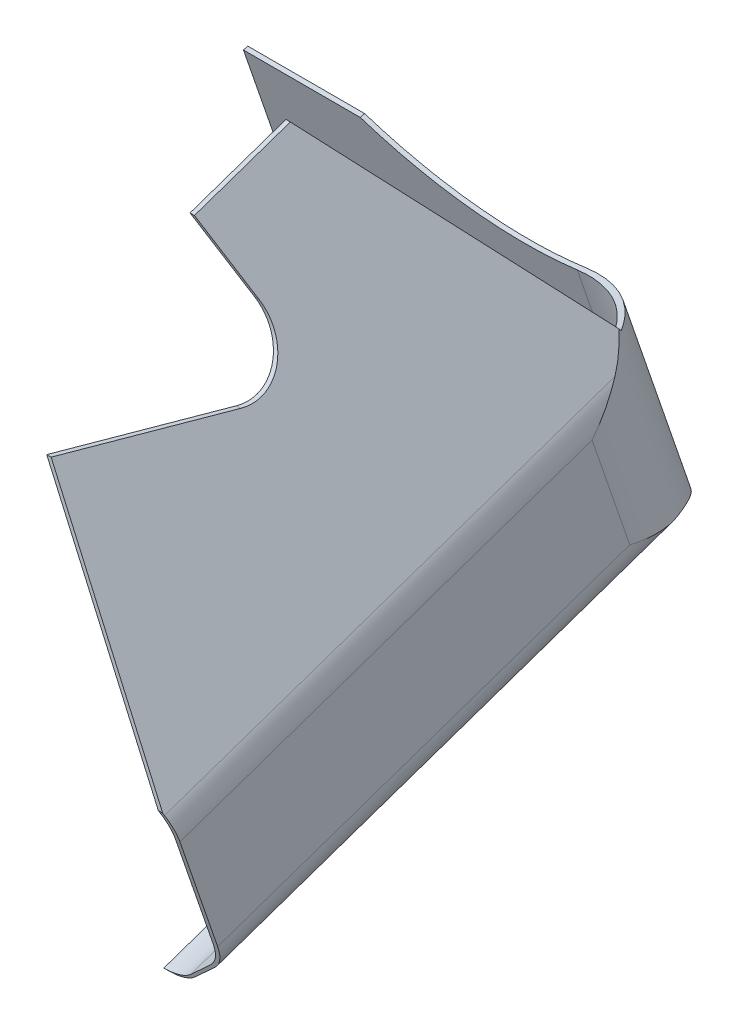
ISO-10303-21;
HEADER;
FILE_DESCRIPTION(('STEP AP214'),'2;1');
FILE_NAME('part.step','',(''),(''),'','','');
FILE_SCHEMA(('AUTOMOTIVE_DESIGN { 1 0 10303 214 1 1 1 1 }'));
ENDSEC;
DATA;
#1=APPLICATION_CONTEXT('core data for automotive mechanical design processes');
#2=APPLICATION_PROTOCOL_DEFINITION('international standard','automotive_design',2000,#1);
#3=PRODUCT_CONTEXT('',#1,'mechanical');
#4=PRODUCT('Part','Part','',(#3));
#5=PRODUCT_RELATED_PRODUCT_CATEGORY('part','',(#4));
#6=PRODUCT_DEFINITION_FORMATION('','',#4);
#7=PRODUCT_DEFINITION_CONTEXT('part definition',#1,'design');
#8=PRODUCT_DEFINITION('design','',#6,#7);
#9=PRODUCT_DEFINITION_SHAPE('','',#8);
#10=(LENGTH_UNIT() NAMED_UNIT(*) SI_UNIT(.MILLI.,.METRE.));
#11=(NAMED_UNIT(*) PLANE_ANGLE_UNIT() SI_UNIT($,.RADIAN.));
#12=(NAMED_UNIT(*) SI_UNIT($,.STERADIAN.) SOLID_ANGLE_UNIT());
#13=UNCERTAINTY_MEASURE_WITH_UNIT(LENGTH_MEASURE(1.E-05),#10,'distance_accuracy_value','');
#14=(GEOMETRIC_REPRESENTATION_CONTEXT(3) GLOBAL_UNCERTAINTY_ASSIGNED_CONTEXT((#13)) GLOBAL_UNIT_ASSIGNED_CONTEXT((#10,
#11,#12)) REPRESENTATION_CONTEXT('',''));
#15=CARTESIAN_POINT('',(0.,0.,0.));
#16=DIRECTION('',(0.,0.,1.));
#17=DIRECTION('',(1.,0.,0.));
#18=AXIS2_PLACEMENT_3D('',#15,#16,#17);
#19=CARTESIAN_POINT('',(-847.312595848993,-306.936207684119,-568.793039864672));
#20=DIRECTION('',(0.,-0.950503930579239,-0.310712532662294));
#21=DIRECTION('',(0.,0.310712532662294,-0.950503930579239));
#22=AXIS2_PLACEMENT_3D('',#19,#20,#21);
#23=PLANE('',#22);
#24=DIRECTION('',(1.,0.,0.));
#25=VECTOR('',#24,1.);
#26=CARTESIAN_POINT('',(-740.959723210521,-310.33590904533,-558.392978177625));
#27=LINE('',#26,#25);
#28=CARTESIAN_POINT('',(-804.459723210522,-310.33590904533,-558.392978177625));
#29=VERTEX_POINT('',#28);
#30=CARTESIAN_POINT('',(-770.733429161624,-310.335909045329,-558.392978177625));
#31=VERTEX_POINT('',#30);
#32=EDGE_CURVE('E234',#29,#31,#27,.T.);
#33=ORIENTED_EDGE('',*,*,#32,.F.);
#34=DIRECTION('',(0.,-0.310712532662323,0.950503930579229));
#35=VECTOR('',#34,1.);
#36=CARTESIAN_POINT('',(-804.459723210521,-310.33590904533,-558.392978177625));
#37=LINE('',#36,#35);
#38=CARTESIAN_POINT('',(-804.459723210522,-310.730562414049,-557.185689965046));
#39=VERTEX_POINT('',#38);
#40=EDGE_CURVE('E231',#29,#39,#37,.T.);
#41=ORIENTED_EDGE('',*,*,#40,.T.);
#42=DIRECTION('',(1.,0.,0.));
#43=VECTOR('',#42,1.);
#44=CARTESIAN_POINT('',(-742.229723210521,-310.730562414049,-557.185689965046));
#45=LINE('',#44,#43);
#46=CARTESIAN_POINT('',(-770.76518439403,-310.730562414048,-557.185689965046));
#47=VERTEX_POINT('',#46);
#48=EDGE_CURVE('E1027',#39,#47,#45,.T.);
#49=ORIENTED_EDGE('',*,*,#48,.T.);
#50=CARTESIAN_POINT('',(-770.76518439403,-310.730562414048,-557.185689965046));
#51=CARTESIAN_POINT('',(-770.763861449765,-310.714118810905,-557.235993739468));
#52=CARTESIAN_POINT('',(-770.762538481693,-310.697675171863,-557.286297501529));
#53=CARTESIAN_POINT('',(-770.759892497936,-310.664787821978,-557.386905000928));
#54=CARTESIAN_POINT('',(-770.758569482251,-310.648344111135,-557.437208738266));
#55=CARTESIAN_POINT('',(-770.755923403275,-310.615456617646,-557.537816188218));
#56=CARTESIAN_POINT('',(-770.754600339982,-310.599012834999,-557.588119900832));
#57=CARTESIAN_POINT('',(-770.751954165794,-310.566125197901,-557.688727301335));
#58=CARTESIAN_POINT('',(-770.750631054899,-310.549681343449,-557.739030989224));
#59=CARTESIAN_POINT('',(-770.747984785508,-310.516793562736,-557.839638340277));
#60=CARTESIAN_POINT('',(-770.746661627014,-310.500349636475,-557.889942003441));
#61=CARTESIAN_POINT('',(-770.74401526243,-310.467461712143,-557.990549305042));
#62=CARTESIAN_POINT('',(-770.74269205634,-310.451017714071,-558.040852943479));
#63=CARTESIAN_POINT('',(-770.740045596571,-310.418129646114,-558.141460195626));
#64=CARTESIAN_POINT('',(-770.738722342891,-310.401685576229,-558.191763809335));
#65=CARTESIAN_POINT('',(-770.736075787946,-310.368797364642,-558.292371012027));
#66=CARTESIAN_POINT('',(-770.734752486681,-310.35235322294,-558.342674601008));
#67=CARTESIAN_POINT('',(-770.733429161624,-310.335909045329,-558.392978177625));
#68=B_SPLINE_CURVE_WITH_KNOTS('',3,(#50,#51,#52,#53,#54,#55,#56,#57,#58,#59,#60,#61,#62,#63,#64,
#65,#66,#67),.UNSPECIFIED.,.F.,.F.,(4,2,2,2,2,2,2,2,4),(0.,0.158819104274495,0.317638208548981,
0.476457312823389,0.63527641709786,0.794095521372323,0.952914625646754,1.1117337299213,
1.27055283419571),.UNSPECIFIED.);
#69=EDGE_CURVE('E236',#47,#31,#68,.T.);
#70=ORIENTED_EDGE('',*,*,#69,.T.);
#71=EDGE_LOOP('',(#33,#41,#49,#70));
#72=FACE_BOUND('',#71,.T.);
#73=ADVANCED_FACE('F36',(#72),#23,.F.);
#74=CARTESIAN_POINT('',(-804.459723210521,-334.500559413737,-482.764892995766));
#75=DIRECTION('',(1.,0.,0.));
#76=DIRECTION('',(0.,0.,-1.));
#77=AXIS2_PLACEMENT_3D('',#74,#75,#76);
#78=PLANE('',#77);
#79=DIRECTION('',(0.,0.945518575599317,0.325568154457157));
#80=VECTOR('',#79,1.);
#81=CARTESIAN_POINT('',(-804.459723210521,-308.6585871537,-557.815429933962));
#82=LINE('',#81,#80);
#83=CARTESIAN_POINT('',(-804.459723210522,-372.30144247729,-579.729422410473));
#84=VERTEX_POINT('',#83);
#85=EDGE_CURVE('E240',#84,#29,#82,.T.);
#86=ORIENTED_EDGE('',*,*,#85,.F.);
#87=DIRECTION('',(0.,-0.325568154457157,0.945518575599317));
#88=VECTOR('',#87,1.);
#89=CARTESIAN_POINT('',(-804.459723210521,-398.143414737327,-504.678885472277));
#90=LINE('',#89,#88);
#91=CARTESIAN_POINT('',(-804.459723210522,-372.71491403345,-578.528613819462));
#92=VERTEX_POINT('',#91);
#93=EDGE_CURVE('E514',#84,#92,#90,.T.);
#94=ORIENTED_EDGE('',*,*,#93,.T.);
#95=DIRECTION('',(0.,0.945518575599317,0.325568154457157));
#96=VECTOR('',#95,1.);
#97=CARTESIAN_POINT('',(-804.459723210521,-309.07205870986,-556.614621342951));
#98=LINE('',#97,#96);
#99=EDGE_CURVE('E246',#92,#39,#98,.T.);
#100=ORIENTED_EDGE('',*,*,#99,.T.);
#101=ORIENTED_EDGE('',*,*,#40,.F.);
#102=EDGE_LOOP('',(#86,#94,#100,#101));
#103=FACE_BOUND('',#102,.T.);
#104=ADVANCED_FACE('F243',(#103),#78,.F.);
#105=CARTESIAN_POINT('',(-740.959723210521,-308.6585871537,-557.815429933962));
#106=DIRECTION('',(0.,0.325568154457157,-0.945518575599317));
#107=DIRECTION('',(0.,0.945518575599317,0.325568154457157));
#108=AXIS2_PLACEMENT_3D('',#105,#106,#107);
#109=PLANE('',#108);
#110=DIRECTION('',(1.,0.,0.));
#111=VECTOR('',#110,1.);
#112=CARTESIAN_POINT('',(-740.959723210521,-372.30144247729,-579.729422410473));
#113=LINE('',#112,#111);
#114=CARTESIAN_POINT('',(-710.479723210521,-372.30144247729,-579.729422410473));
#115=VERTEX_POINT('',#114);
#116=EDGE_CURVE('E251',#115,#84,#113,.F.);
#117=ORIENTED_EDGE('',*,*,#116,.T.);
#118=ORIENTED_EDGE('',*,*,#85,.T.);
#119=ORIENTED_EDGE('',*,*,#32,.T.);
#120=CARTESIAN_POINT('',(-770.733429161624,-310.33590904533,-558.392978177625));
#121=CARTESIAN_POINT('',(-766.67805028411,-312.737870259,-559.220039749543));
#122=CARTESIAN_POINT('',(-762.353602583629,-314.67531873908,-559.88715676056));
#123=CARTESIAN_POINT('',(-757.999495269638,-316.62605538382,-560.5588492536));
#124=CARTESIAN_POINT('',(-753.431835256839,-318.07911528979,-561.05917790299));
#125=CARTESIAN_POINT('',(-748.865201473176,-319.531848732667,-561.559394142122));
#126=CARTESIAN_POINT('',(-744.148436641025,-320.466602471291,-561.881255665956));
#127=CARTESIAN_POINT('',(-739.465381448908,-321.394675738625,-562.200816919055));
#128=CARTESIAN_POINT('',(-734.698635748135,-321.799013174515,-562.340041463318));
#129=B_SPLINE_CURVE_WITH_KNOTS('',2,(#120,#121,#122,#123,#124,#125,#126,#127,#128),
.UNSPECIFIED.,.F.,.F.,(3,2,2,2,3),(0.,0.25,0.5,0.75,1.),.UNSPECIFIED.);
#130=CARTESIAN_POINT('',(-734.698635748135,-321.799013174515,-562.340041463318));
#131=VERTEX_POINT('',#130);
#132=EDGE_CURVE('E697',#31,#131,#129,.T.);
#133=ORIENTED_EDGE('',*,*,#132,.T.);
#134=CARTESIAN_POINT('',(-727.406587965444,-244.939142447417,-535.875065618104));
#135=DIRECTION('',(0.,0.325568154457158,-0.945518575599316));
#136=DIRECTION('',(0.,0.945518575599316,0.325568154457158));
#137=AXIS2_PLACEMENT_3D('',#134,#135,#136);
#138=CIRCLE('',#137,81.6150025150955);
#139=CARTESIAN_POINT('',(-710.479723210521,-320.429726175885,-561.868558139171));
#140=VERTEX_POINT('',#139);
#141=EDGE_CURVE('E359',#131,#140,#138,.F.);
#142=ORIENTED_EDGE('',*,*,#141,.T.);
#143=DIRECTION('',(0.,-0.945518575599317,-0.325568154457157));
#144=VECTOR('',#143,1.);
#145=CARTESIAN_POINT('',(-710.479723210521,-308.6585871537,-557.815429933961));
#146=LINE('',#145,#144);
#147=EDGE_CURVE('E364',#115,#140,#146,.F.);
#148=ORIENTED_EDGE('',*,*,#147,.F.);
#149=EDGE_LOOP('',(#117,#118,#119,#133,#142,#148));
#150=FACE_BOUND('',#149,.T.);
#151=ADVANCED_FACE('F249',(#150),#109,.T.);
#152=CARTESIAN_POINT('',(-742.229723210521,-309.07205870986,-556.614621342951));
#153=DIRECTION('',(0.,0.325568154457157,-0.945518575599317));
#154=DIRECTION('',(0.,0.945518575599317,0.325568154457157));
#155=AXIS2_PLACEMENT_3D('',#152,#153,#154);
#156=PLANE('',#155);
#157=ORIENTED_EDGE('',*,*,#99,.F.);
#158=DIRECTION('',(1.,0.,0.));
#159=VECTOR('',#158,1.);
#160=CARTESIAN_POINT('',(-740.959723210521,-372.71491403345,-578.528613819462));
#161=LINE('',#160,#159);
#162=CARTESIAN_POINT('',(-711.749723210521,-372.71491403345,-578.528613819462));
#163=VERTEX_POINT('',#162);
#164=EDGE_CURVE('E506',#92,#163,#161,.T.);
#165=ORIENTED_EDGE('',*,*,#164,.T.);
#166=DIRECTION('',(0.,0.945518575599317,0.325568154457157));
#167=VECTOR('',#166,1.);
#168=CARTESIAN_POINT('',(-711.749723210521,-309.07205870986,-556.614621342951));
#169=LINE('',#168,#167);
#170=CARTESIAN_POINT('',(-711.749723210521,-321.087832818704,-560.751984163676));
#171=VERTEX_POINT('',#170);
#172=EDGE_CURVE('E253',#171,#163,#169,.F.);
#173=ORIENTED_EDGE('',*,*,#172,.F.);
#174=CARTESIAN_POINT('',(-727.406587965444,-245.352614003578,-534.674257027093));
#175=DIRECTION('',(0.,0.325568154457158,-0.945518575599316));
#176=DIRECTION('',(0.,0.945518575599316,0.325568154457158));
#177=AXIS2_PLACEMENT_3D('',#174,#175,#176);
#178=CIRCLE('',#177,81.6150025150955);
#179=CARTESIAN_POINT('',(-734.698635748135,-322.212484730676,-561.139232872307));
#180=VERTEX_POINT('',#179);
#181=EDGE_CURVE('E354',#171,#180,#178,.T.);
#182=ORIENTED_EDGE('',*,*,#181,.T.);
#183=CARTESIAN_POINT('',(-734.698635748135,-322.212484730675,-561.139232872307));
#184=CARTESIAN_POINT('',(-739.470014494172,-321.807754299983,-560.999873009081));
#185=CARTESIAN_POINT('',(-744.157510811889,-320.878275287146,-560.679827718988));
#186=CARTESIAN_POINT('',(-748.878812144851,-319.942093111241,-560.357474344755));
#187=CARTESIAN_POINT('',(-753.449594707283,-318.486935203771,-559.856423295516));
#188=CARTESIAN_POINT('',(-758.021403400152,-317.031450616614,-559.35525976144));
#189=CARTESIAN_POINT('',(-762.379089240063,-315.077366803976,-558.682414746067));
#190=CARTESIAN_POINT('',(-766.707031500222,-313.136620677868,-558.014162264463));
#191=CARTESIAN_POINT('',(-770.76518439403,-310.730562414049,-557.185689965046));
#192=B_SPLINE_CURVE_WITH_KNOTS('',2,(#183,#184,#185,#186,#187,#188,#189,#190,#191),
.UNSPECIFIED.,.F.,.F.,(3,2,2,2,3),(0.,0.25,0.5,0.75,1.),.UNSPECIFIED.);
#193=EDGE_CURVE('E1023',#180,#47,#192,.T.);
#194=ORIENTED_EDGE('',*,*,#193,.T.);
#195=ORIENTED_EDGE('',*,*,#48,.F.);
#196=EDGE_LOOP('',(#157,#165,#173,#182,#194,#195));
#197=FACE_BOUND('',#196,.T.);
#198=ADVANCED_FACE('F283',(#197),#156,.F.);
#199=CARTESIAN_POINT('',(-711.749723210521,-318.714892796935,-525.012280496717));
#200=DIRECTION('',(0.,-0.945518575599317,-0.325568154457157));
#201=DIRECTION('',(0.,0.325568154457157,-0.945518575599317));
#202=AXIS2_PLACEMENT_3D('',#199,#200,#201);
#203=CYLINDRICAL_SURFACE('',#202,33.02);
#204=CARTESIAN_POINT('',(-688.401057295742,-369.997911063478,-567.364471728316));
#205=CARTESIAN_POINT('',(-688.100297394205,-369.811466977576,-566.982178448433));
#206=CARTESIAN_POINT('',(-687.803386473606,-369.631201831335,-566.593801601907));
#207=CARTESIAN_POINT('',(-687.22499246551,-369.287914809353,-565.814337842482));
#208=CARTESIAN_POINT('',(-686.943310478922,-369.124585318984,-565.42353379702));
#209=CARTESIAN_POINT('',(-686.395393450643,-368.814891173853,-564.639996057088));
#210=CARTESIAN_POINT('',(-686.128950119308,-368.668214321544,-564.247531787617));
#211=CARTESIAN_POINT('',(-685.611502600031,-368.391573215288,-563.46145064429));
#212=CARTESIAN_POINT('',(-685.360281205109,-368.261291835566,-563.068088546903));
#213=CARTESIAN_POINT('',(-684.863618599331,-368.01237620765,-562.26543650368));
#214=CARTESIAN_POINT('',(-684.618318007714,-367.893942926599,-561.855996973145));
#215=CARTESIAN_POINT('',(-684.143354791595,-367.67405097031,-561.035841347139));
#216=CARTESIAN_POINT('',(-683.913471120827,-367.57228618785,-560.625335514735));
#217=CARTESIAN_POINT('',(-683.469366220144,-367.385491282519,-559.803748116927));
#218=CARTESIAN_POINT('',(-683.254917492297,-367.30015468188,-559.39285957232));
#219=CARTESIAN_POINT('',(-682.841683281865,-367.145991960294,-558.571222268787));
#220=CARTESIAN_POINT('',(-682.642664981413,-367.07685972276,-558.160647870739));
#221=CARTESIAN_POINT('',(-682.449467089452,-367.01522101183,-557.746204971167));
#222=B_SPLINE_CURVE_WITH_KNOTS('',3,(#204,#205,#206,#207,#208,#209,#210,#211,#212,#213,#214,
#215,#216,#217,#218,#219,#220,#221),.UNSPECIFIED.,.F.,.F.,(4,2,2,2,2,2,2,2,4),(0.,
1.56274206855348,3.08841079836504,4.57761047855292,6.03099089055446,7.50588627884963,
8.94957873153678,10.3629619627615,11.7469884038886),.UNSPECIFIED.);
#223=CARTESIAN_POINT('',(-688.401057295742,-369.997911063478,-567.364471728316));
#224=VERTEX_POINT('',#223);
#225=CARTESIAN_POINT('',(-682.449467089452,-367.01522101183,-557.746204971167));
#226=VERTEX_POINT('',#225);
#227=EDGE_CURVE('E1118',#224,#226,#222,.T.);
#228=ORIENTED_EDGE('',*,*,#227,.T.);
#229=CARTESIAN_POINT('',(-679.696453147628,-365.494215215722,-549.508183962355));
#230=CARTESIAN_POINT('',(-679.78224362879,-365.577171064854,-549.903418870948));
#231=CARTESIAN_POINT('',(-679.873885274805,-365.659025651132,-550.297623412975));
#232=CARTESIAN_POINT('',(-680.065961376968,-365.817561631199,-551.071471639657));
#233=CARTESIAN_POINT('',(-680.166035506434,-365.8943247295,-551.451188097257));
#234=CARTESIAN_POINT('',(-680.374005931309,-366.04249784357,-552.196000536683));
#235=CARTESIAN_POINT('',(-680.481550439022,-366.114000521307,-552.561176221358));
#236=CARTESIAN_POINT('',(-680.70351953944,-366.25154473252,-553.276864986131));
#237=CARTESIAN_POINT('',(-680.817600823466,-366.31768857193,-553.627464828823));
#238=CARTESIAN_POINT('',(-681.051731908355,-366.444473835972,-554.313984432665));
#239=CARTESIAN_POINT('',(-681.171446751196,-366.505225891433,-554.649997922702));
#240=CARTESIAN_POINT('',(-681.415969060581,-366.621247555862,-555.307346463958));
#241=CARTESIAN_POINT('',(-681.540449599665,-366.676634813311,-555.628782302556));
#242=CARTESIAN_POINT('',(-681.793662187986,-366.782002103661,-556.256999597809));
#243=CARTESIAN_POINT('',(-681.922075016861,-366.832105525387,-556.563888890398));
#244=CARTESIAN_POINT('',(-682.18236126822,-366.927031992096,-557.163040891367));
#245=CARTESIAN_POINT('',(-682.313922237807,-366.971982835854,-557.455419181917));
#246=CARTESIAN_POINT('',(-682.449467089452,-367.01522101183,-557.746204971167));
#247=B_SPLINE_CURVE_WITH_KNOTS('',3,(#229,#230,#231,#232,#233,#234,#235,#236,#237,#238,#239,
#240,#241,#242,#243,#244,#245,#246),.UNSPECIFIED.,.F.,.F.,(4,2,2,2,2,2,2,2,4),(0.,
1.2385432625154,2.4387189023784,3.60057311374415,4.72415682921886,5.80952638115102,
6.85674428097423,7.86588014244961,8.83701178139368),.UNSPECIFIED.);
#248=CARTESIAN_POINT('',(-679.696453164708,-365.494215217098,-549.508183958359));
#249=VERTEX_POINT('',#248);
#250=EDGE_CURVE('E403',#249,#226,#247,.T.);
#251=ORIENTED_EDGE('',*,*,#250,.F.);
#252=CARTESIAN_POINT('',(-678.729723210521,-363.481155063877,-540.426540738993));
#253=CARTESIAN_POINT('',(-678.729720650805,-363.586164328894,-540.88845037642));
#254=CARTESIAN_POINT('',(-678.737085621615,-363.691279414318,-541.350333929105));
#255=CARTESIAN_POINT('',(-678.764759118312,-363.888229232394,-542.217172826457));
#256=CARTESIAN_POINT('',(-678.78337176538,-363.980113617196,-542.622171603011));
#257=CARTESIAN_POINT('',(-678.828572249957,-364.150343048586,-543.375162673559));
#258=CARTESIAN_POINT('',(-678.853684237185,-364.228787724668,-543.723221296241));
#259=CARTESIAN_POINT('',(-678.907587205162,-364.37230620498,-544.362358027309));
#260=CARTESIAN_POINT('',(-678.935120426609,-364.437484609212,-544.653519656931));
#261=CARTESIAN_POINT('',(-679.009849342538,-364.596478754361,-545.365947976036));
#262=CARTESIAN_POINT('',(-679.060322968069,-364.690013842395,-545.786938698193));
#263=CARTESIAN_POINT('',(-679.170341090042,-364.869727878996,-546.601743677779));
#264=CARTESIAN_POINT('',(-679.229137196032,-364.956005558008,-546.995637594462));
#265=CARTESIAN_POINT('',(-679.353649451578,-365.121212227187,-547.756235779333));
#266=CARTESIAN_POINT('',(-679.418660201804,-365.20025243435,-548.123031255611));
#267=CARTESIAN_POINT('',(-679.553610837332,-365.351130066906,-548.829462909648));
#268=CARTESIAN_POINT('',(-679.622886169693,-365.423084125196,-549.169201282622));
#269=CARTESIAN_POINT('',(-679.696453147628,-365.494215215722,-549.508183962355));
#270=B_SPLINE_CURVE_WITH_KNOTS('',3,(#252,#253,#254,#255,#256,#257,#258,#259,#260,#261,#262,
#263,#264,#265,#266,#267,#268,#269),.UNSPECIFIED.,.F.,.F.,(4,2,2,2,2,2,2,2,4),(0.,
1.42102251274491,2.66799166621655,3.7409040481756,4.63975744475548,5.94215949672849,
7.16449553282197,8.30677804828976,9.36902258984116),.UNSPECIFIED.);
#271=CARTESIAN_POINT('',(-678.729723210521,-363.481155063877,-540.426540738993));
#272=VERTEX_POINT('',#271);
#273=EDGE_CURVE('E397',#272,#249,#270,.T.);
#274=ORIENTED_EDGE('',*,*,#273,.F.);
#275=DIRECTION('',(0.,-0.945518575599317,-0.325568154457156));
#276=VECTOR('',#275,1.);
#277=CARTESIAN_POINT('',(-678.729723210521,-331.863735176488,-529.539790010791));
#278=LINE('',#277,#276);
#279=CARTESIAN_POINT('',(-678.729723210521,-331.863735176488,-529.539790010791));
#280=VERTEX_POINT('',#279);
#281=EDGE_CURVE('E391',#280,#272,#278,.T.);
#282=ORIENTED_EDGE('',*,*,#281,.F.);
#283=CARTESIAN_POINT('',(-678.729723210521,-331.863735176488,-529.539790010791));
#284=CARTESIAN_POINT('',(-678.729723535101,-331.635831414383,-529.725650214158));
#285=CARTESIAN_POINT('',(-678.732560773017,-331.407917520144,-529.91149696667));
#286=CARTESIAN_POINT('',(-678.742555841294,-331.006607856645,-530.238766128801));
#287=CARTESIAN_POINT('',(-678.74852010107,-330.833190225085,-530.380198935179));
#288=CARTESIAN_POINT('',(-678.761351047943,-330.540857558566,-530.618660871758));
#289=CARTESIAN_POINT('',(-678.767347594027,-330.421912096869,-530.71570020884));
#290=CARTESIAN_POINT('',(-678.781516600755,-330.173208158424,-530.918748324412));
#291=CARTESIAN_POINT('',(-678.789838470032,-330.043461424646,-531.02476112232));
#292=CARTESIAN_POINT('',(-678.80813020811,-329.786962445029,-531.234437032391));
#293=CARTESIAN_POINT('',(-678.81805957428,-329.660207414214,-531.338100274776));
#294=CARTESIAN_POINT('',(-678.839446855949,-329.409700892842,-531.543068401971));
#295=CARTESIAN_POINT('',(-678.850865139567,-329.285946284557,-531.644373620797));
#296=CARTESIAN_POINT('',(-678.879628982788,-328.995946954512,-531.88191459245));
#297=CARTESIAN_POINT('',(-678.897660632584,-328.829767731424,-532.018147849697));
#298=CARTESIAN_POINT('',(-678.936140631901,-328.503373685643,-532.286014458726));
#299=CARTESIAN_POINT('',(-678.95648687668,-328.343146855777,-532.417647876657));
#300=CARTESIAN_POINT('',(-678.999297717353,-328.028655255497,-532.676294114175));
#301=CARTESIAN_POINT('',(-679.021663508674,-327.874377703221,-532.803307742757));
#302=CARTESIAN_POINT('',(-679.068225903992,-327.5717892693,-533.052711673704));
#303=CARTESIAN_POINT('',(-679.092326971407,-327.423464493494,-533.175102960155));
#304=CARTESIAN_POINT('',(-679.142082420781,-327.13278100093,-533.415263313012));
#305=CARTESIAN_POINT('',(-679.16764452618,-326.990407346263,-533.53303341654));
#306=CARTESIAN_POINT('',(-679.220055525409,-326.711625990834,-533.763961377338));
#307=CARTESIAN_POINT('',(-679.246815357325,-326.575202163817,-533.877119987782));
#308=CARTESIAN_POINT('',(-679.274654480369,-326.43899351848,-533.990272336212));
#309=B_SPLINE_CURVE_WITH_KNOTS('',3,(#283,#284,#285,#286,#287,#288,#289,#290,#291,#292,#293,
#294,#295,#296,#297,#298,#299,#300,#301,#302,#303,#304,#305,#306,#307,#308),.UNSPECIFIED.,.F.,
.F.,(4,2,2,2,2,2,2,2,2,2,2,2,4),(0.,0.882229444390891,1.55377964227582,2.01464711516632,
2.51790548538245,3.01003751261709,3.49104358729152,4.13793726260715,4.76299792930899,
5.36622769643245,5.94762891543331,6.50720421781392,7.04495656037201),.UNSPECIFIED.);
#310=CARTESIAN_POINT('',(-679.274654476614,-326.438993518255,-533.990272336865));
#311=VERTEX_POINT('',#310);
#312=EDGE_CURVE('E390',#280,#311,#309,.T.);
#313=ORIENTED_EDGE('',*,*,#312,.T.);
#314=CARTESIAN_POINT('',(-679.274654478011,-326.438993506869,-533.990272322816));
#315=CARTESIAN_POINT('',(-679.362942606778,-326.007096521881,-534.349079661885));
#316=CARTESIAN_POINT('',(-679.462063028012,-325.577302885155,-534.707790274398));
#317=CARTESIAN_POINT('',(-679.682097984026,-324.723883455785,-535.424344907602));
#318=CARTESIAN_POINT('',(-679.802975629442,-324.300248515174,-535.782189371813));
#319=CARTESIAN_POINT('',(-680.066952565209,-323.459637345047,-536.497553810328));
#320=CARTESIAN_POINT('',(-680.210052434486,-323.042661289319,-536.855073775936));
#321=CARTESIAN_POINT('',(-680.519123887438,-322.216109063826,-537.570289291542));
#322=CARTESIAN_POINT('',(-680.685133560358,-321.806546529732,-537.92798412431));
#323=CARTESIAN_POINT('',(-680.862684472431,-321.40176110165,-538.285419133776));
#324=B_SPLINE_CURVE_WITH_KNOTS('',3,(#314,#315,#316,#317,#318,#319,#320,#321,#322,#323),
.UNSPECIFIED.,.F.,.F.,(4,2,2,2,4),(0.,1.70511015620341,3.4073560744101,5.10964634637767,
6.81480168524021),.UNSPECIFIED.);
#325=CARTESIAN_POINT('',(-680.862684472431,-321.40176110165,-538.285419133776));
#326=VERTEX_POINT('',#325);
#327=EDGE_CURVE('E459',#311,#326,#324,.T.);
#328=ORIENTED_EDGE('',*,*,#327,.T.);
#329=CARTESIAN_POINT('',(-711.749723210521,-281.396444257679,-512.162508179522));
#330=DIRECTION('',(0.832050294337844,0.52447933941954,0.180592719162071));
#331=DIRECTION('',(0.554700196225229,-0.78671900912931,-0.270889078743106));
#332=AXIS2_PLACEMENT_3D('',#329,#330,#331);
#333=ELLIPSE('',#332,59.5276515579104,33.02);
#334=CARTESIAN_POINT('',(-685.189590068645,-312.678982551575,-543.682724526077));
#335=VERTEX_POINT('',#334);
#336=EDGE_CURVE('E161',#326,#335,#333,.T.);
#337=ORIENTED_EDGE('',*,*,#336,.T.);
#338=CARTESIAN_POINT('',(-711.749723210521,-276.686735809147,-510.540825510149));
#339=DIRECTION('',(0.,-0.677377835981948,0.735635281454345));
#340=DIRECTION('',(0.,-0.735635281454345,-0.677377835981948));
#341=AXIS2_PLACEMENT_3D('',#338,#339,#340);
#342=ELLIPSE('',#341,82.3494983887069,33.02);
#343=CARTESIAN_POINT('',(-685.226612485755,-312.770757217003,-543.767231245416));
#344=VERTEX_POINT('',#343);
#345=EDGE_CURVE('E447',#335,#344,#342,.F.);
#346=ORIENTED_EDGE('',*,*,#345,.T.);
#347=CARTESIAN_POINT('',(-685.226612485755,-312.770757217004,-543.767231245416));
#348=CARTESIAN_POINT('',(-685.160401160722,-312.893730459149,-543.715142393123));
#349=CARTESIAN_POINT('',(-685.094440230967,-313.016544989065,-543.662359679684));
#350=CARTESIAN_POINT('',(-684.963582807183,-313.260816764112,-543.555831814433));
#351=CARTESIAN_POINT('',(-684.898682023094,-313.382276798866,-543.502098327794));
#352=CARTESIAN_POINT('',(-684.769945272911,-313.623835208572,-543.393681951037));
#353=CARTESIAN_POINT('',(-684.706104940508,-313.743936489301,-543.33901072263));
#354=CARTESIAN_POINT('',(-684.579489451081,-313.982772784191,-543.228731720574));
#355=CARTESIAN_POINT('',(-684.516709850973,-314.101510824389,-543.173135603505));
#356=CARTESIAN_POINT('',(-684.392215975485,-314.337616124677,-543.06101964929));
#357=CARTESIAN_POINT('',(-684.330497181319,-314.454986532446,-543.004511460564));
#358=CARTESIAN_POINT('',(-684.208124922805,-314.688352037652,-542.890584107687));
#359=CARTESIAN_POINT('',(-684.147466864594,-314.804350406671,-542.833176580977));
#360=CARTESIAN_POINT('',(-684.027215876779,-315.034967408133,-542.717463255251));
#361=CARTESIAN_POINT('',(-683.967618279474,-315.149589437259,-542.659169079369));
#362=CARTESIAN_POINT('',(-683.849488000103,-315.377449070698,-542.541695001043));
#363=CARTESIAN_POINT('',(-683.790950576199,-315.490690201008,-542.482526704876));
#364=CARTESIAN_POINT('',(-683.732699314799,-315.603714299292,-542.422669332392));
#365=B_SPLINE_CURVE_WITH_KNOTS('',3,(#347,#348,#349,#350,#351,#352,#353,#354,#355,#356,#357,
#358,#359,#360,#361,#362,#363,#364),.UNSPECIFIED.,.F.,.F.,(4,2,2,2,2,2,2,2,4),(0.,
0.447185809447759,0.890650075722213,1.33041435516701,1.76650075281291,2.19893193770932,
2.62773115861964,3.05292226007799,3.47452969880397),.UNSPECIFIED.);
#366=CARTESIAN_POINT('',(-683.732699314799,-315.603714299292,-542.422669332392));
#367=VERTEX_POINT('',#366);
#368=EDGE_CURVE('E265',#344,#367,#365,.T.);
#369=ORIENTED_EDGE('',*,*,#368,.T.);
#370=CARTESIAN_POINT('',(-683.732699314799,-315.603714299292,-542.422669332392));
#371=CARTESIAN_POINT('',(-684.067329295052,-315.629481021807,-542.998945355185));
#372=CARTESIAN_POINT('',(-684.416313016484,-315.664269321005,-543.566407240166));
#373=CARTESIAN_POINT('',(-685.141649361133,-315.749980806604,-544.682018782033));
#374=CARTESIAN_POINT('',(-685.517992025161,-315.800898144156,-545.230175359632));
#375=CARTESIAN_POINT('',(-686.29741211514,-315.917049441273,-546.306547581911));
#376=CARTESIAN_POINT('',(-686.700520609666,-315.982300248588,-546.834738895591));
#377=CARTESIAN_POINT('',(-687.532048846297,-316.125327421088,-547.869201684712));
#378=CARTESIAN_POINT('',(-687.960474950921,-316.203106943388,-548.375467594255));
#379=CARTESIAN_POINT('',(-689.085176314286,-316.415524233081,-549.638112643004));
#380=CARTESIAN_POINT('',(-689.798604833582,-316.557825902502,-550.378057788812));
#381=CARTESIAN_POINT('',(-691.280303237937,-316.862866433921,-551.796501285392));
#382=CARTESIAN_POINT('',(-692.048586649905,-317.025610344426,-552.474984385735));
#383=CARTESIAN_POINT('',(-693.637457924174,-317.366642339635,-553.76607306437));
#384=CARTESIAN_POINT('',(-694.458122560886,-317.54495338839,-554.378578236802));
#385=CARTESIAN_POINT('',(-696.146657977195,-317.912253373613,-555.53088516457));
#386=CARTESIAN_POINT('',(-697.014523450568,-318.101241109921,-556.070695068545));
#387=CARTESIAN_POINT('',(-698.797064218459,-318.486637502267,-557.074169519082));
#388=CARTESIAN_POINT('',(-699.71193269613,-318.68307574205,-557.537480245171));
#389=CARTESIAN_POINT('',(-701.57969249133,-319.078885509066,-558.379124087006));
#390=CARTESIAN_POINT('',(-702.532591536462,-319.278257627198,-558.75743982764));
#391=CARTESIAN_POINT('',(-704.46683320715,-319.67605254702,-559.422172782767));
#392=CARTESIAN_POINT('',(-705.448082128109,-319.874476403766,-559.708861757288));
#393=CARTESIAN_POINT('',(-707.433694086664,-320.268197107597,-560.186464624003));
#394=CARTESIAN_POINT('',(-708.43803790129,-320.463496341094,-560.377455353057));
#395=CARTESIAN_POINT('',(-709.831242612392,-320.728945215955,-560.571769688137));
#396=CARTESIAN_POINT('',(-710.214052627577,-320.801320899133,-560.617906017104));
#397=CARTESIAN_POINT('',(-710.980949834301,-320.945216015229,-560.695765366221));
#398=CARTESIAN_POINT('',(-711.365035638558,-321.016736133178,-560.727500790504));
#399=CARTESIAN_POINT('',(-711.749723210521,-321.087832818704,-560.751984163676));
#400=B_SPLINE_CURVE_WITH_KNOTS('',3,(#370,#371,#372,#373,#374,#375,#376,#377,#378,#379,#380,
#381,#382,#383,#384,#385,#386,#387,#388,#389,#390,#391,#392,#393,#394,#395,#396,#397,#398,#399),
.UNSPECIFIED.,.F.,.F.,(4,2,2,2,2,2,2,2,2,2,2,2,2,2,4),(0.,2.00028332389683,3.99984211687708,
6.00176391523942,8.0041909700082,11.1134813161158,14.2235410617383,17.3382687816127,
20.452647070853,23.5810491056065,26.7100900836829,29.8297624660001,32.9469260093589,
34.1236577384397,35.2993739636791),.UNSPECIFIED.);
#401=EDGE_CURVE('E348',#367,#171,#400,.T.);
#402=ORIENTED_EDGE('',*,*,#401,.T.);
#403=ORIENTED_EDGE('',*,*,#172,.T.);
#404=CARTESIAN_POINT('',(-711.749723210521,-383.465174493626,-547.307590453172));
#405=DIRECTION('',(0.,-0.945518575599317,-0.325568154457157));
#406=DIRECTION('',(0.,0.325568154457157,-0.945518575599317));
#407=AXIS2_PLACEMENT_3D('',#404,#405,#406);
#408=CIRCLE('',#407,33.0200000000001);
#409=CARTESIAN_POINT('',(-699.86523545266,-373.435353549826,-576.436305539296));
#410=VERTEX_POINT('',#409);
#411=EDGE_CURVE('E410',#163,#410,#408,.T.);
#412=ORIENTED_EDGE('',*,*,#411,.T.);
#413=CARTESIAN_POINT('',(-699.86523545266,-373.435353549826,-576.436305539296));
#414=CARTESIAN_POINT('',(-699.655526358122,-373.461700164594,-576.35982400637));
#415=CARTESIAN_POINT('',(-699.446652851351,-373.483954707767,-576.279657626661));
#416=CARTESIAN_POINT('',(-699.030519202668,-373.520362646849,-576.112002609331));
#417=CARTESIAN_POINT('',(-698.823264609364,-373.534495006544,-576.024495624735));
#418=CARTESIAN_POINT('',(-698.410459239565,-373.554651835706,-575.84218960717));
#419=CARTESIAN_POINT('',(-698.204920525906,-373.560639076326,-575.747359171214));
#420=CARTESIAN_POINT('',(-697.795627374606,-373.5645152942,-575.550451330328));
#421=CARTESIAN_POINT('',(-697.591893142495,-373.562351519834,-575.448330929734));
#422=CARTESIAN_POINT('',(-697.186289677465,-373.549929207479,-575.236884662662));
#423=CARTESIAN_POINT('',(-696.984450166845,-373.539603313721,-575.127505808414));
#424=CARTESIAN_POINT('',(-696.582713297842,-373.510860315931,-574.901585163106));
#425=CARTESIAN_POINT('',(-696.382856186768,-373.492362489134,-574.784982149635));
#426=CARTESIAN_POINT('',(-695.985164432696,-373.447275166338,-574.544655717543));
#427=CARTESIAN_POINT('',(-695.787381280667,-373.420592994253,-574.420864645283));
#428=CARTESIAN_POINT('',(-695.393899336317,-373.359141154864,-574.166203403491));
#429=CARTESIAN_POINT('',(-695.198263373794,-373.324268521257,-574.035260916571));
#430=CARTESIAN_POINT('',(-695.005155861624,-373.285625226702,-573.901785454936));
#431=B_SPLINE_CURVE_WITH_KNOTS('',3,(#413,#414,#415,#416,#417,#418,#419,#420,#421,#422,#423,
#424,#425,#426,#427,#428,#429,#430),.UNSPECIFIED.,.F.,.F.,(4,2,2,2,2,2,2,2,4),(0.,
0.674233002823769,1.35020446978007,2.0292553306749,2.71270839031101,3.40186110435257,
4.09797905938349,4.80229029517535,5.51598055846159),.UNSPECIFIED.);
#432=CARTESIAN_POINT('',(-695.005155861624,-373.285625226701,-573.901785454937));
#433=VERTEX_POINT('',#432);
#434=EDGE_CURVE('E409',#410,#433,#431,.T.);
#435=ORIENTED_EDGE('',*,*,#434,.T.);
#436=CARTESIAN_POINT('',(-695.005155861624,-373.285625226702,-573.901785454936));
#437=CARTESIAN_POINT('',(-694.809049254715,-373.246395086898,-573.766252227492));
#438=CARTESIAN_POINT('',(-694.61556798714,-373.203182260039,-573.628084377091));
#439=CARTESIAN_POINT('',(-694.233762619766,-373.108770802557,-573.346697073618));
#440=CARTESIAN_POINT('',(-694.04544820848,-373.057558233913,-573.203469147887));
#441=CARTESIAN_POINT('',(-693.673948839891,-372.94707905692,-572.912168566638));
#442=CARTESIAN_POINT('',(-693.490783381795,-372.887785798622,-572.764081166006));
#443=CARTESIAN_POINT('',(-693.12953509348,-372.761092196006,-572.463267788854));
#444=CARTESIAN_POINT('',(-692.951482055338,-372.693653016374,-572.310522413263));
#445=CARTESIAN_POINT('',(-692.605846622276,-372.552828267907,-572.005390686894));
#446=CARTESIAN_POINT('',(-692.438114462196,-372.479629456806,-571.853087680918));
#447=CARTESIAN_POINT('',(-692.109483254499,-372.326151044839,-571.546370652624));
#448=CARTESIAN_POINT('',(-691.948556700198,-372.245905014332,-571.391969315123));
#449=CARTESIAN_POINT('',(-691.633399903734,-372.078246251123,-571.08133586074));
#450=CARTESIAN_POINT('',(-691.479150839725,-371.990855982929,-570.925110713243));
#451=CARTESIAN_POINT('',(-691.177195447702,-371.808840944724,-570.611096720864));
#452=CARTESIAN_POINT('',(-691.029479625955,-371.714227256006,-570.453310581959));
#453=CARTESIAN_POINT('',(-690.884979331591,-371.615941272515,-570.294870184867));
#454=B_SPLINE_CURVE_WITH_KNOTS('',3,(#436,#437,#438,#439,#440,#441,#442,#443,#444,#445,#446,
#447,#448,#449,#450,#451,#452,#453),.UNSPECIFIED.,.F.,.F.,(4,2,2,2,2,2,2,2,4),(0.,
0.72470171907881,1.45068047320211,2.17911420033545,2.91116898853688,3.62524170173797,
4.33608037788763,5.04476403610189,5.75238155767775),.UNSPECIFIED.);
#455=CARTESIAN_POINT('',(-690.884979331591,-371.615941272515,-570.294870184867));
#456=VERTEX_POINT('',#455);
#457=EDGE_CURVE('E552',#433,#456,#454,.T.);
#458=ORIENTED_EDGE('',*,*,#457,.T.);
#459=CARTESIAN_POINT('',(-690.88497933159,-371.615941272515,-570.294870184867));
#460=CARTESIAN_POINT('',(-690.775277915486,-371.541335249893,-570.174592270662));
#461=CARTESIAN_POINT('',(-690.66593505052,-371.467356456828,-570.053597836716));
#462=CARTESIAN_POINT('',(-690.448923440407,-371.321305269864,-569.811217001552));
#463=CARTESIAN_POINT('',(-690.341248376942,-371.249221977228,-569.689842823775));
#464=CARTESIAN_POINT('',(-690.127573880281,-371.106950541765,-569.446734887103));
#465=CARTESIAN_POINT('',(-690.021568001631,-371.036751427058,-569.325013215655));
#466=CARTESIAN_POINT('',(-689.811232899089,-370.898237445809,-569.081242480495));
#467=CARTESIAN_POINT('',(-689.706897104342,-370.829911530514,-568.959205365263));
#468=CARTESIAN_POINT('',(-689.499902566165,-370.69513306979,-568.714835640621));
#469=CARTESIAN_POINT('',(-689.397237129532,-370.628669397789,-568.592514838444));
#470=CARTESIAN_POINT('',(-689.193583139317,-370.497604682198,-568.347609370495));
#471=CARTESIAN_POINT('',(-689.092587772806,-370.432992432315,-568.225036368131));
#472=CARTESIAN_POINT('',(-688.892273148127,-370.305619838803,-567.979657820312));
#473=CARTESIAN_POINT('',(-688.792946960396,-370.242848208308,-567.85686379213));
#474=CARTESIAN_POINT('',(-688.595969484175,-370.119146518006,-567.611074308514));
#475=CARTESIAN_POINT('',(-688.498311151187,-370.058205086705,-567.488090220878));
#476=CARTESIAN_POINT('',(-688.401057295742,-369.997911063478,-567.364471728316));
#477=B_SPLINE_CURVE_WITH_KNOTS('',3,(#459,#460,#461,#462,#463,#464,#465,#466,#467,#468,#469,
#470,#471,#472,#473,#474,#475,#476),.UNSPECIFIED.,.F.,.F.,(4,2,2,2,2,2,2,2,4),(0.,
0.53721733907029,1.06983555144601,1.59786928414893,2.12133356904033,2.64024383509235,
3.1546159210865,3.66446608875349,4.1698110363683),.UNSPECIFIED.);
#478=EDGE_CURVE('E344',#456,#224,#477,.T.);
#479=ORIENTED_EDGE('',*,*,#478,.T.);
#480=EDGE_LOOP('',(#228,#251,#274,#282,#313,#328,#337,#346,#369,#402,#403,#412,#435,#458,#479));
#481=FACE_BOUND('',#480,.T.);
#482=ADVANCED_FACE('F272',(#481),#203,.F.);
#483=CARTESIAN_POINT('',(-683.732699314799,-376.698123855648,-364.99162053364));
#484=DIRECTION('',(0.832049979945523,0.524479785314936,0.180592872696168));
#485=DIRECTION('',(-0.533247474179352,0.845959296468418,0.));
#486=AXIS2_PLACEMENT_3D('',#483,#484,#485);
#487=PLANE('',#486);
#488=DIRECTION('',(-0.440375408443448,0.822536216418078,-0.359866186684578));
#489=VECTOR('',#488,1.);
#490=CARTESIAN_POINT('',(-683.732699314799,-314.57556037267,-545.408645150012));
#491=LINE('',#490,#489);
#492=CARTESIAN_POINT('',(-683.732699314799,-314.575560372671,-545.408645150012));
#493=VERTEX_POINT('',#492);
#494=CARTESIAN_POINT('',(-683.740764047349,-314.56049700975,-545.415235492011));
#495=VERTEX_POINT('',#494);
#496=EDGE_CURVE('E428',#493,#495,#491,.T.);
#497=ORIENTED_EDGE('',*,*,#496,.F.);
#498=DIRECTION('',(0.,0.325568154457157,-0.945518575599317));
#499=VECTOR('',#498,1.);
#500=CARTESIAN_POINT('',(-683.732699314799,-376.698123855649,-364.99162053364));
#501=LINE('',#500,#499);
#502=EDGE_CURVE('E355',#493,#367,#501,.F.);
#503=ORIENTED_EDGE('',*,*,#502,.T.);
#504=ORIENTED_EDGE('',*,*,#368,.F.);
#505=DIRECTION('',(0.521211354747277,-0.627811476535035,-0.578092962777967));
#506=VECTOR('',#505,1.);
#507=CARTESIAN_POINT('',(-685.226612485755,-312.770757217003,-543.767231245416));
#508=LINE('',#507,#506);
#509=EDGE_CURVE('E438',#344,#495,#508,.T.);
#510=ORIENTED_EDGE('',*,*,#509,.T.);
#511=EDGE_LOOP('',(#497,#503,#504,#510));
#512=FACE_BOUND('',#511,.T.);
#513=ADVANCED_FACE('F282',(#512),#487,.F.);
#514=CARTESIAN_POINT('',(-740.959723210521,-270.857704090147,-460.850900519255));
#515=DIRECTION('',(0.,-0.945518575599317,-0.325568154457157));
#516=DIRECTION('',(0.,0.325568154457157,-0.945518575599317));
#517=AXIS2_PLACEMENT_3D('',#514,#515,#516);
#518=PLANE('',#517);
#519=DIRECTION('',(0.,-0.325568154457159,0.945518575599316));
#520=VECTOR('',#519,1.);
#521=CARTESIAN_POINT('',(-728.259723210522,-259.270171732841,-494.503538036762));
#522=LINE('',#521,#520);
#523=CARTESIAN_POINT('',(-728.259723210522,-259.270171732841,-494.503538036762));
#524=VERTEX_POINT('',#523);
#525=CARTESIAN_POINT('',(-728.259723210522,-268.794099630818,-466.844043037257));
#526=VERTEX_POINT('',#525);
#527=EDGE_CURVE('E431',#524,#526,#522,.T.);
#528=ORIENTED_EDGE('',*,*,#527,.F.);
#529=DIRECTION('',(1.,0.,0.));
#530=VECTOR('',#529,1.);
#531=CARTESIAN_POINT('',(-847.312595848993,-259.270171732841,-494.503538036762));
#532=LINE('',#531,#530);
#533=CARTESIAN_POINT('',(-729.529723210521,-259.270171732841,-494.503538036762));
#534=VERTEX_POINT('',#533);
#535=EDGE_CURVE('E417',#524,#534,#532,.F.);
#536=ORIENTED_EDGE('',*,*,#535,.T.);
#537=DIRECTION('',(0.,-0.325568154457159,0.945518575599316));
#538=VECTOR('',#537,1.);
#539=CARTESIAN_POINT('',(-729.529723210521,-259.270171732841,-494.503538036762));
#540=LINE('',#539,#538);
#541=CARTESIAN_POINT('',(-729.529723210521,-268.794099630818,-466.844043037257));
#542=VERTEX_POINT('',#541);
#543=EDGE_CURVE('E170',#534,#542,#540,.T.);
#544=ORIENTED_EDGE('',*,*,#543,.T.);
#545=DIRECTION('',(1.,0.,0.));
#546=VECTOR('',#545,1.);
#547=CARTESIAN_POINT('',(-847.312595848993,-268.794099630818,-466.844043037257));
#548=LINE('',#547,#546);
#549=EDGE_CURVE('E426',#542,#526,#548,.T.);
#550=ORIENTED_EDGE('',*,*,#549,.T.);
#551=EDGE_LOOP('',(#528,#536,#544,#550));
#552=FACE_BOUND('',#551,.T.);
#553=ADVANCED_FACE('F727',(#552),#518,.F.);
#554=CARTESIAN_POINT('',(-847.312595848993,-262.186834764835,-464.568979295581));
#555=DIRECTION('',(0.,0.325568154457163,-0.945518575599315));
#556=DIRECTION('',(0.,0.945518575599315,0.325568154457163));
#557=AXIS2_PLACEMENT_3D('',#554,#555,#556);
#558=PLANE('',#557);
#559=ORIENTED_EDGE('',*,*,#549,.F.);
#560=DIRECTION('',(0.554700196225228,-0.786719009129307,-0.270889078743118));
#561=VECTOR('',#560,1.);
#562=CARTESIAN_POINT('',(-729.529723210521,-268.794099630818,-466.844043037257));
#563=LINE('',#562,#561);
#564=CARTESIAN_POINT('',(-716.993303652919,-286.574225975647,-472.966231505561));
#565=VERTEX_POINT('',#564);
#566=EDGE_CURVE('E452',#542,#565,#563,.T.);
#567=ORIENTED_EDGE('',*,*,#566,.T.);
#568=DIRECTION('',(1.,0.,0.));
#569=VECTOR('',#568,1.);
#570=CARTESIAN_POINT('',(-847.312595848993,-286.574225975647,-472.966231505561));
#571=LINE('',#570,#569);
#572=CARTESIAN_POINT('',(-715.72330365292,-286.574225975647,-472.966231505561));
#573=VERTEX_POINT('',#572);
#574=EDGE_CURVE('E423',#565,#573,#571,.T.);
#575=ORIENTED_EDGE('',*,*,#574,.T.);
#576=DIRECTION('',(0.554700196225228,-0.786719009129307,-0.270889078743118));
#577=VECTOR('',#576,1.);
#578=CARTESIAN_POINT('',(-728.259723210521,-268.794099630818,-466.844043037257));
#579=LINE('',#578,#577);
#580=EDGE_CURVE('E434',#526,#573,#579,.T.);
#581=ORIENTED_EDGE('',*,*,#580,.F.);
#582=EDGE_LOOP('',(#559,#567,#575,#581));
#583=FACE_BOUND('',#582,.T.);
#584=ADVANCED_FACE('F719',(#583),#558,.F.);
#585=CARTESIAN_POINT('',(-709.919736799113,-290.708941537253,-460.958145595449));
#586=DIRECTION('',(1.,0.,0.));
#587=DIRECTION('',(0.,0.,-1.));
#588=AXIS2_PLACEMENT_3D('',#585,#586,#587);
#589=CYLINDRICAL_SURFACE('',#588,12.7);
#590=CARTESIAN_POINT('',(-716.993303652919,-290.708941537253,-460.958145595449));
#591=DIRECTION('',(0.832050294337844,0.52447933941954,0.180592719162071));
#592=DIRECTION('',(0.554700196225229,-0.78671900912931,-0.270889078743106));
#593=AXIS2_PLACEMENT_3D('',#590,#591,#592);
#594=ELLIPSE('',#593,15.2635003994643,12.7);
#595=CARTESIAN_POINT('',(-709.242007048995,-303.365833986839,-459.912644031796));
#596=VERTEX_POINT('',#595);
#597=EDGE_CURVE('E471',#565,#596,#594,.F.);
#598=ORIENTED_EDGE('',*,*,#597,.T.);
#599=DIRECTION('',(1.,0.,0.));
#600=VECTOR('',#599,1.);
#601=CARTESIAN_POINT('',(-847.312595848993,-303.365833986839,-459.912644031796));
#602=LINE('',#601,#600);
#603=CARTESIAN_POINT('',(-707.972007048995,-303.365833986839,-459.912644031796));
#604=VERTEX_POINT('',#603);
#605=EDGE_CURVE('E420',#596,#604,#602,.T.);
#606=ORIENTED_EDGE('',*,*,#605,.T.);
#607=CARTESIAN_POINT('',(-715.723303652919,-290.708941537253,-460.958145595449));
#608=DIRECTION('',(0.832050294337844,0.52447933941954,0.180592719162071));
#609=DIRECTION('',(0.554700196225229,-0.78671900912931,-0.270889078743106));
#610=AXIS2_PLACEMENT_3D('',#607,#608,#609);
#611=ELLIPSE('',#610,15.2635003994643,12.7);
#612=EDGE_CURVE('E571',#573,#604,#611,.F.);
#613=ORIENTED_EDGE('',*,*,#612,.F.);
#614=ORIENTED_EDGE('',*,*,#574,.F.);
#615=EDGE_LOOP('',(#598,#606,#613,#614));
#616=FACE_BOUND('',#615,.T.);
#617=ADVANCED_FACE('F721',(#616),#589,.F.);
#618=CARTESIAN_POINT('',(-847.312595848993,-303.365833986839,-459.912644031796));
#619=DIRECTION('',(0.,-0.996605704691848,0.0823229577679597));
#620=DIRECTION('',(0.,-0.0823229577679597,-0.996605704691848));
#621=AXIS2_PLACEMENT_3D('',#618,#619,#620);
#622=PLANE('',#621);
#623=ORIENTED_EDGE('',*,*,#605,.F.);
#624=DIRECTION('',(-0.259045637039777,0.0795128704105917,0.962586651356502));
#625=VECTOR('',#624,1.);
#626=CARTESIAN_POINT('',(-709.242007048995,-303.365833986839,-459.912644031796));
#627=LINE('',#626,#625);
#628=CARTESIAN_POINT('',(-720.839363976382,-299.806078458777,-416.818071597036));
#629=VERTEX_POINT('',#628);
#630=EDGE_CURVE('E377',#596,#629,#627,.T.);
#631=ORIENTED_EDGE('',*,*,#630,.T.);
#632=DIRECTION('',(1.,0.,0.));
#633=VECTOR('',#632,1.);
#634=CARTESIAN_POINT('',(-847.312595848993,-299.806078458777,-416.818071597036));
#635=LINE('',#634,#633);
#636=CARTESIAN_POINT('',(-719.569363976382,-299.806078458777,-416.818071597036));
#637=VERTEX_POINT('',#636);
#638=EDGE_CURVE('E376',#629,#637,#635,.T.);
#639=ORIENTED_EDGE('',*,*,#638,.T.);
#640=DIRECTION('',(-0.259045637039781,0.0795128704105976,0.962586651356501));
#641=VECTOR('',#640,1.);
#642=CARTESIAN_POINT('',(-707.972007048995,-303.365833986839,-459.912644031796));
#643=LINE('',#642,#641);
#644=EDGE_CURVE('E567',#604,#637,#643,.T.);
#645=ORIENTED_EDGE('',*,*,#644,.F.);
#646=EDGE_LOOP('',(#623,#631,#639,#645));
#647=FACE_BOUND('',#646,.T.);
#648=ADVANCED_FACE('F489',(#647),#622,.F.);
#649=CARTESIAN_POINT('',(-698.59523545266,-411.977301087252,-425.493632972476));
#650=DIRECTION('',(0.,0.325568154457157,-0.945518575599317));
#651=DIRECTION('',(0.,0.945518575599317,0.325568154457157));
#652=AXIS2_PLACEMENT_3D('',#649,#650,#651);
#653=CYLINDRICAL_SURFACE('',#652,12.7);
#654=DIRECTION('',(0.,-0.325568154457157,0.945518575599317));
#655=VECTOR('',#654,1.);
#656=CARTESIAN_POINT('',(-698.59523545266,-398.143414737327,-504.678885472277));
#657=LINE('',#656,#655);
#658=CARTESIAN_POINT('',(-698.59523545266,-423.985386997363,-429.628348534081));
#659=VERTEX_POINT('',#658);
#660=CARTESIAN_POINT('',(-698.59523545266,-373.021881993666,-577.637114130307));
#661=VERTEX_POINT('',#660);
#662=EDGE_CURVE('E422',#659,#661,#657,.F.);
#663=ORIENTED_EDGE('',*,*,#662,.T.);
#664=CARTESIAN_POINT('',(-689.614979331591,-371.202469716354,-571.495678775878));
#665=CARTESIAN_POINT('',(-689.764159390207,-371.303914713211,-571.659240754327));
#666=CARTESIAN_POINT('',(-689.91676480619,-371.401390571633,-571.822086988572));
#667=CARTESIAN_POINT('',(-690.228680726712,-371.588508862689,-572.145848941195));
#668=CARTESIAN_POINT('',(-690.387991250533,-371.678151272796,-572.306764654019));
#669=CARTESIAN_POINT('',(-690.87577839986,-371.935494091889,-572.785883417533));
#670=CARTESIAN_POINT('',(-691.214094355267,-372.091599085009,-573.100440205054));
#671=CARTESIAN_POINT('',(-691.904281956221,-372.368357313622,-573.70587702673));
#672=CARTESIAN_POINT('',(-692.255389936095,-372.489973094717,-573.997190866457));
#673=CARTESIAN_POINT('',(-692.979370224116,-372.703561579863,-574.563220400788));
#674=CARTESIAN_POINT('',(-693.352241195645,-372.795536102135,-574.837937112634));
#675=CARTESIAN_POINT('',(-694.102558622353,-372.945667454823,-575.356529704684));
#676=CARTESIAN_POINT('',(-694.479207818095,-373.00504330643,-575.601204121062));
#677=CARTESIAN_POINT('',(-695.248976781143,-373.094232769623,-576.068874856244));
#678=CARTESIAN_POINT('',(-695.642091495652,-373.124055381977,-576.291877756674));
#679=CARTESIAN_POINT('',(-696.454903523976,-373.153102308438,-576.719801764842));
#680=CARTESIAN_POINT('',(-696.875046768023,-373.151354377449,-576.923952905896));
#681=CARTESIAN_POINT('',(-697.51402175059,-373.122704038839,-577.208261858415));
#682=CARTESIAN_POINT('',(-697.728643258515,-373.10879494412,-577.299440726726));
#683=CARTESIAN_POINT('',(-698.160273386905,-373.07207068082,-577.474120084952));
#684=CARTESIAN_POINT('',(-698.377282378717,-373.049254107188,-577.557619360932));
#685=CARTESIAN_POINT('',(-698.59523545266,-373.021881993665,-577.637114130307));
#686=B_SPLINE_CURVE_WITH_KNOTS('',3,(#664,#665,#666,#667,#668,#669,#670,#671,#672,#673,#674,
#675,#676,#677,#678,#679,#680,#681,#682,#683,#684,#685),.UNSPECIFIED.,.F.,.F.,(4,2,2,2,2,2,2,2,
2,2,4),(0.,0.730410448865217,1.46082299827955,2.92172749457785,4.33657297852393,
5.75133165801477,7.10877834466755,8.46581147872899,9.86470510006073,10.5652391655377,
11.2658837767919),.UNSPECIFIED.);
#687=CARTESIAN_POINT('',(-689.614979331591,-371.202469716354,-571.495678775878));
#688=VERTEX_POINT('',#687);
#689=EDGE_CURVE('E443',#688,#661,#686,.T.);
#690=ORIENTED_EDGE('',*,*,#689,.F.);
#691=DIRECTION('',(0.,0.325568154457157,-0.945518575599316));
#692=VECTOR('',#691,1.);
#693=CARTESIAN_POINT('',(-689.614979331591,-420.468300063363,-428.417318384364));
#694=LINE('',#693,#692);
#695=CARTESIAN_POINT('',(-689.614979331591,-420.468300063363,-428.417318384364));
#696=VERTEX_POINT('',#695);
#697=EDGE_CURVE('E582',#696,#688,#694,.T.);
#698=ORIENTED_EDGE('',*,*,#697,.F.);
#699=CARTESIAN_POINT('',(-698.59523545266,-411.977301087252,-425.493632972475));
#700=DIRECTION('',(0.,0.325568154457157,-0.945518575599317));
#701=DIRECTION('',(0.,0.945518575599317,0.325568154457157));
#702=AXIS2_PLACEMENT_3D('',#699,#700,#701);
#703=CIRCLE('',#702,12.7);
#704=EDGE_CURVE('E604',#696,#659,#703,.T.);
#705=ORIENTED_EDGE('',*,*,#704,.T.);
#706=EDGE_LOOP('',(#663,#690,#698,#705));
#707=FACE_BOUND('',#706,.T.);
#708=ADVANCED_FACE('F483',(#707),#653,.T.);
#709=CARTESIAN_POINT('',(-740.959723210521,-398.143414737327,-504.678885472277));
#710=DIRECTION('',(0.,0.945518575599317,0.325568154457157));
#711=DIRECTION('',(0.,-0.325568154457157,0.945518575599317));
#712=AXIS2_PLACEMENT_3D('',#709,#710,#711);
#713=PLANE('',#712);
#714=ORIENTED_EDGE('',*,*,#411,.F.);
#715=ORIENTED_EDGE('',*,*,#164,.F.);
#716=ORIENTED_EDGE('',*,*,#93,.F.);
#717=ORIENTED_EDGE('',*,*,#116,.F.);
#718=CARTESIAN_POINT('',(-710.479723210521,-383.051702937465,-548.508399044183));
#719=DIRECTION('',(0.,-0.945518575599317,-0.325568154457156));
#720=DIRECTION('',(0.,0.325568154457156,-0.945518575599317));
#721=AXIS2_PLACEMENT_3D('',#718,#719,#720);
#722=CIRCLE('',#721,33.02);
#723=EDGE_CURVE('E456',#661,#115,#722,.F.);
#724=ORIENTED_EDGE('',*,*,#723,.F.);
#725=ORIENTED_EDGE('',*,*,#662,.F.);
#726=DIRECTION('',(1.,0.,0.));
#727=VECTOR('',#726,1.);
#728=CARTESIAN_POINT('',(-740.959723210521,-423.985386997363,-429.628348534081));
#729=LINE('',#728,#727);
#730=CARTESIAN_POINT('',(-699.865235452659,-423.985386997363,-429.628348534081));
#731=VERTEX_POINT('',#730);
#732=EDGE_CURVE('E601',#659,#731,#729,.F.);
#733=ORIENTED_EDGE('',*,*,#732,.T.);
#734=DIRECTION('',(0.,0.325568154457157,-0.945518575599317));
#735=VECTOR('',#734,1.);
#736=CARTESIAN_POINT('',(-699.865235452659,-398.556886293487,-503.478076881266));
#737=LINE('',#736,#735);
#738=EDGE_CURVE('E406',#731,#410,#737,.T.);
#739=ORIENTED_EDGE('',*,*,#738,.T.);
#740=EDGE_LOOP('',(#714,#715,#716,#717,#724,#725,#733,#739));
#741=FACE_BOUND('',#740,.T.);
#742=ADVANCED_FACE('F488',(#741),#713,.F.);
#743=CARTESIAN_POINT('',(-699.865235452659,-411.977301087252,-425.493632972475));
#744=DIRECTION('',(0.,0.325568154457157,-0.945518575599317));
#745=DIRECTION('',(0.,0.945518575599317,0.325568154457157));
#746=AXIS2_PLACEMENT_3D('',#743,#744,#745);
#747=CYLINDRICAL_SURFACE('',#746,12.7);
#748=CARTESIAN_POINT('',(-699.865235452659,-411.977301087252,-425.493632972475));
#749=DIRECTION('',(0.,0.325568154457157,-0.945518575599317));
#750=DIRECTION('',(0.,0.945518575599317,0.325568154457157));
#751=AXIS2_PLACEMENT_3D('',#748,#749,#750);
#752=CIRCLE('',#751,12.7);
#753=CARTESIAN_POINT('',(-690.88497933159,-420.468300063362,-428.417318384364));
#754=VERTEX_POINT('',#753);
#755=EDGE_CURVE('E600',#731,#754,#752,.F.);
#756=ORIENTED_EDGE('',*,*,#755,.T.);
#757=DIRECTION('',(0.,0.325568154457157,-0.945518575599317));
#758=VECTOR('',#757,1.);
#759=CARTESIAN_POINT('',(-690.88497933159,-420.468300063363,-428.417318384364));
#760=LINE('',#759,#758);
#761=EDGE_CURVE('E544',#754,#456,#760,.T.);
#762=ORIENTED_EDGE('',*,*,#761,.T.);
#763=ORIENTED_EDGE('',*,*,#457,.F.);
#764=ORIENTED_EDGE('',*,*,#434,.F.);
#765=ORIENTED_EDGE('',*,*,#738,.F.);
#766=EDGE_LOOP('',(#756,#762,#763,#764,#765));
#767=FACE_BOUND('',#766,.T.);
#768=ADVANCED_FACE('F495',(#767),#747,.F.);
#769=CARTESIAN_POINT('',(-686.667223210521,-391.051832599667,-500.893879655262));
#770=DIRECTION('',(0.707106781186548,-0.668582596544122,-0.230211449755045));
#771=DIRECTION('',(0.687035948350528,0.726623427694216,0.));
#772=AXIS2_PLACEMENT_3D('',#769,#770,#771);
#773=PLANE('',#772);
#774=ORIENTED_EDGE('',*,*,#227,.F.);
#775=ORIENTED_EDGE('',*,*,#478,.F.);
#776=ORIENTED_EDGE('',*,*,#761,.F.);
#777=DIRECTION('',(0.707106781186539,0.668582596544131,0.230211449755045));
#778=VECTOR('',#777,1.);
#779=CARTESIAN_POINT('',(-690.88497933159,-420.468300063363,-428.417318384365));
#780=LINE('',#779,#778);
#781=CARTESIAN_POINT('',(-682.449467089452,-412.492366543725,-425.670984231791));
#782=VERTEX_POINT('',#781);
#783=EDGE_CURVE('E597',#754,#782,#780,.T.);
#784=ORIENTED_EDGE('',*,*,#783,.T.);
#785=DIRECTION('',(0.,-0.325568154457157,0.945518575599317));
#786=VECTOR('',#785,1.);
#787=CARTESIAN_POINT('',(-682.449467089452,-387.063865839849,-499.520712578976));
#788=LINE('',#787,#786);
#789=EDGE_CURVE('E400',#226,#782,#788,.T.);
#790=ORIENTED_EDGE('',*,*,#789,.F.);
#791=EDGE_LOOP('',(#774,#775,#776,#784,#790));
#792=FACE_BOUND('',#791,.T.);
#793=ADVANCED_FACE('F528',(#792),#773,.F.);
#794=CARTESIAN_POINT('',(-691.429723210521,-360.640304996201,-548.676968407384));
#795=DIRECTION('',(0.,-0.325568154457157,0.945518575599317));
#796=DIRECTION('',(0.,-0.945518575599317,-0.325568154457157));
#797=AXIS2_PLACEMENT_3D('',#794,#795,#796);
#798=CYLINDRICAL_SURFACE('',#797,12.7);
#799=DIRECTION('',(0.,-0.325568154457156,0.945518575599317));
#800=VECTOR('',#799,1.);
#801=CARTESIAN_POINT('',(-678.729723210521,-363.481155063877,-540.426540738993));
#802=LINE('',#801,#800);
#803=CARTESIAN_POINT('',(-678.729723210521,-404.001367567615,-422.747298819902));
#804=VERTEX_POINT('',#803);
#805=EDGE_CURVE('E394',#272,#804,#802,.T.);
#806=ORIENTED_EDGE('',*,*,#805,.F.);
#807=ORIENTED_EDGE('',*,*,#273,.T.);
#808=ORIENTED_EDGE('',*,*,#250,.T.);
#809=ORIENTED_EDGE('',*,*,#789,.T.);
#810=CARTESIAN_POINT('',(-691.429723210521,-404.001367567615,-422.747298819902));
#811=DIRECTION('',(0.,-0.325568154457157,0.945518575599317));
#812=DIRECTION('',(0.,-0.945518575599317,-0.325568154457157));
#813=AXIS2_PLACEMENT_3D('',#810,#811,#812);
#814=CIRCLE('',#813,12.7);
#815=EDGE_CURVE('E596',#782,#804,#814,.T.);
#816=ORIENTED_EDGE('',*,*,#815,.T.);
#817=EDGE_LOOP('',(#806,#807,#808,#809,#816));
#818=FACE_BOUND('',#817,.T.);
#819=ADVANCED_FACE('F537',(#818),#798,.F.);
#820=CARTESIAN_POINT('',(-678.729723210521,-334.914030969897,-481.564084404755));
#821=DIRECTION('',(-1.,0.,0.));
#822=DIRECTION('',(0.,-1.,0.));
#823=AXIS2_PLACEMENT_3D('',#820,#821,#822);
#824=PLANE('',#823);
#825=DIRECTION('',(0.,0.325568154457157,-0.945518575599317));
#826=VECTOR('',#825,1.);
#827=CARTESIAN_POINT('',(-678.729723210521,-346.95544697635,-485.710276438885));
#828=LINE('',#827,#826);
#829=CARTESIAN_POINT('',(-678.729723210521,-372.383947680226,-411.8605480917));
#830=VERTEX_POINT('',#829);
#831=EDGE_CURVE('E387',#830,#280,#828,.T.);
#832=ORIENTED_EDGE('',*,*,#831,.T.);
#833=ORIENTED_EDGE('',*,*,#281,.T.);
#834=ORIENTED_EDGE('',*,*,#805,.T.);
#835=DIRECTION('',(0.,0.945518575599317,0.325568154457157));
#836=VECTOR('',#835,1.);
#837=CARTESIAN_POINT('',(-678.729723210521,-360.342531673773,-407.71435605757));
#838=LINE('',#837,#836);
#839=EDGE_CURVE('E593',#804,#830,#838,.T.);
#840=ORIENTED_EDGE('',*,*,#839,.T.);
#841=EDGE_LOOP('',(#832,#833,#834,#840));
#842=FACE_BOUND('',#841,.T.);
#843=ADVANCED_FACE('F793',(#842),#824,.T.);
#844=CARTESIAN_POINT('',(-691.429723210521,-372.383947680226,-411.8605480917));
#845=DIRECTION('',(0.,0.325568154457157,-0.945518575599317));
#846=DIRECTION('',(0.,0.945518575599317,0.325568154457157));
#847=AXIS2_PLACEMENT_3D('',#844,#845,#846);
#848=CYLINDRICAL_SURFACE('',#847,12.7);
#849=CARTESIAN_POINT('',(-691.429723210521,-372.383947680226,-411.8605480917));
#850=DIRECTION('',(0.,0.325568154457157,-0.945518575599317));
#851=DIRECTION('',(0.,0.945518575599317,0.325568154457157));
#852=AXIS2_PLACEMENT_3D('',#849,#850,#851);
#853=CIRCLE('',#852,12.7);
#854=CARTESIAN_POINT('',(-680.862684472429,-365.7230600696,-409.567020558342));
#855=VERTEX_POINT('',#854);
#856=EDGE_CURVE('E590',#830,#855,#853,.F.);
#857=ORIENTED_EDGE('',*,*,#856,.T.);
#858=DIRECTION('',(0.,0.325568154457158,-0.945518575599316));
#859=VECTOR('',#858,1.);
#860=CARTESIAN_POINT('',(-680.86268447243,-365.723060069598,-409.567020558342));
#861=LINE('',#860,#859);
#862=EDGE_CURVE('E467',#855,#326,#861,.T.);
#863=ORIENTED_EDGE('',*,*,#862,.T.);
#864=ORIENTED_EDGE('',*,*,#327,.F.);
#865=ORIENTED_EDGE('',*,*,#312,.F.);
#866=ORIENTED_EDGE('',*,*,#831,.F.);
#867=EDGE_LOOP('',(#857,#863,#864,#865,#866));
#868=FACE_BOUND('',#867,.T.);
#869=ADVANCED_FACE('F465',(#868),#848,.F.);
#870=CARTESIAN_POINT('',(-704.129723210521,-307.295433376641,-472.054238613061));
#871=DIRECTION('',(0.832050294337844,0.52447933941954,0.180592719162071));
#872=DIRECTION('',(-0.533247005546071,0.845959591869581,0.));
#873=AXIS2_PLACEMENT_3D('',#870,#871,#872);
#874=PLANE('',#873);
#875=ORIENTED_EDGE('',*,*,#630,.F.);
#876=ORIENTED_EDGE('',*,*,#597,.F.);
#877=ORIENTED_EDGE('',*,*,#566,.F.);
#878=ORIENTED_EDGE('',*,*,#543,.F.);
#879=DIRECTION('',(0.521210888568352,-0.627811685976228,-0.578093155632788));
#880=VECTOR('',#879,1.);
#881=CARTESIAN_POINT('',(-729.529723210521,-259.270171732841,-494.503538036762));
#882=LINE('',#881,#880);
#883=EDGE_CURVE('E357',#534,#335,#882,.T.);
#884=ORIENTED_EDGE('',*,*,#883,.T.);
#885=ORIENTED_EDGE('',*,*,#336,.F.);
#886=ORIENTED_EDGE('',*,*,#862,.F.);
#887=DIRECTION('',(-0.554700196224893,0.786719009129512,0.270889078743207));
#888=VECTOR('',#887,1.);
#889=CARTESIAN_POINT('',(-680.862684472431,-365.723060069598,-409.567020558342));
#890=LINE('',#889,#888);
#891=CARTESIAN_POINT('',(-681.221861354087,-365.213647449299,-409.391615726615));
#892=VERTEX_POINT('',#891);
#893=EDGE_CURVE('E384',#855,#892,#890,.T.);
#894=ORIENTED_EDGE('',*,*,#893,.T.);
#895=DIRECTION('',(-0.515651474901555,0.851328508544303,-0.096660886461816));
#896=VECTOR('',#895,1.);
#897=CARTESIAN_POINT('',(-681.221861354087,-365.213647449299,-409.391615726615));
#898=LINE('',#897,#896);
#899=EDGE_CURVE('E373',#892,#629,#898,.T.);
#900=ORIENTED_EDGE('',*,*,#899,.T.);
#901=EDGE_LOOP('',(#875,#876,#877,#878,#884,#885,#886,#894,#900));
#902=FACE_BOUND('',#901,.T.);
#903=ADVANCED_FACE('F706',(#902),#874,.F.);
#904=CARTESIAN_POINT('',(-847.312595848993,-299.806078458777,-416.818071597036));
#905=DIRECTION('',(0.,-0.112816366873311,-0.99361585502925));
#906=DIRECTION('',(0.,0.99361585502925,-0.112816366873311));
#907=AXIS2_PLACEMENT_3D('',#904,#905,#906);
#908=PLANE('',#907);
#909=ORIENTED_EDGE('',*,*,#638,.F.);
#910=ORIENTED_EDGE('',*,*,#899,.F.);
#911=DIRECTION('',(1.,0.,0.));
#912=VECTOR('',#911,1.);
#913=CARTESIAN_POINT('',(-740.959723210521,-365.213647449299,-409.391615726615));
#914=LINE('',#913,#912);
#915=CARTESIAN_POINT('',(-679.951861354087,-365.213647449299,-409.391615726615));
#916=VERTEX_POINT('',#915);
#917=EDGE_CURVE('E380',#892,#916,#914,.T.);
#918=ORIENTED_EDGE('',*,*,#917,.T.);
#919=DIRECTION('',(0.515651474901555,-0.851328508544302,0.0966608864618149));
#920=VECTOR('',#919,1.);
#921=CARTESIAN_POINT('',(-719.569363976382,-299.806078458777,-416.818071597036));
#922=LINE('',#921,#920);
#923=EDGE_CURVE('E413',#637,#916,#922,.T.);
#924=ORIENTED_EDGE('',*,*,#923,.F.);
#925=EDGE_LOOP('',(#909,#910,#918,#924));
#926=FACE_BOUND('',#925,.T.);
#927=ADVANCED_FACE('F710',(#926),#908,.F.);
#928=CARTESIAN_POINT('',(-727.406587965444,-250.446500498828,-519.880536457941));
#929=DIRECTION('',(0.,0.325568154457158,-0.945518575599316));
#930=DIRECTION('',(0.,0.945518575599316,0.325568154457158));
#931=AXIS2_PLACEMENT_3D('',#928,#929,#930);
#932=CYLINDRICAL_SURFACE('',#931,81.6150025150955);
#933=ORIENTED_EDGE('',*,*,#181,.F.);
#934=ORIENTED_EDGE('',*,*,#401,.F.);
#935=ORIENTED_EDGE('',*,*,#502,.F.);
#936=CARTESIAN_POINT('',(-710.479723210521,-320.429726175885,-561.868558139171));
#937=CARTESIAN_POINT('',(-710.007023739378,-320.334977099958,-561.835942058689));
#938=CARTESIAN_POINT('',(-709.535234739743,-320.239552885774,-561.792341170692));
#939=CARTESIAN_POINT('',(-708.594428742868,-320.047524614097,-561.683540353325));
#940=CARTESIAN_POINT('',(-708.125411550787,-319.950920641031,-561.618341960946));
#941=CARTESIAN_POINT('',(-707.191312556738,-319.756747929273,-561.466757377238));
#942=CARTESIAN_POINT('',(-706.726228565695,-319.659179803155,-561.380383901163));
#943=CARTESIAN_POINT('',(-705.800600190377,-319.46323540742,-561.186882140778));
#944=CARTESIAN_POINT('',(-705.340055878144,-319.364859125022,-561.079753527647));
#945=CARTESIAN_POINT('',(-703.96893903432,-319.069389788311,-560.728568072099));
#946=CARTESIAN_POINT('',(-703.066126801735,-318.871382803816,-560.454260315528));
#947=CARTESIAN_POINT('',(-701.287536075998,-318.475184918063,-559.829157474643));
#948=CARTESIAN_POINT('',(-700.41176062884,-318.276993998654,-559.478353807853));
#949=CARTESIAN_POINT('',(-698.69412974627,-317.883426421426,-558.705739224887));
#950=CARTESIAN_POINT('',(-697.852197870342,-317.688044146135,-558.284100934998));
#951=CARTESIAN_POINT('',(-696.204114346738,-317.302463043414,-557.373822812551));
#952=CARTESIAN_POINT('',(-695.397965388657,-317.112264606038,-556.885177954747));
#953=CARTESIAN_POINT('',(-693.825523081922,-316.740387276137,-555.845800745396));
#954=CARTESIAN_POINT('',(-693.059204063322,-316.558702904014,-555.295109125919));
#955=CARTESIAN_POINT('',(-691.56914460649,-316.207317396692,-554.135908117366));
#956=CARTESIAN_POINT('',(-690.845388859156,-316.037611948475,-553.527419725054));
#957=CARTESIAN_POINT('',(-689.615333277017,-315.75381436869,-552.412791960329));
#958=CARTESIAN_POINT('',(-689.099285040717,-315.636300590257,-551.918222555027));
#959=CARTESIAN_POINT('',(-688.09454273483,-315.412258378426,-550.900683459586));
#960=CARTESIAN_POINT('',(-687.605822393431,-315.305719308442,-550.377742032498));
#961=CARTESIAN_POINT('',(-686.516212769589,-315.075918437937,-549.146215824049));
#962=CARTESIAN_POINT('',(-685.924773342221,-314.956997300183,-548.428381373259));
#963=CARTESIAN_POINT('',(-685.074641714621,-314.798262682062,-547.31972893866));
#964=CARTESIAN_POINT('',(-684.79720547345,-314.748590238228,-546.944513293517));
#965=CARTESIAN_POINT('',(-684.255211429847,-314.656485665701,-546.184023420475));
#966=CARTESIAN_POINT('',(-683.990653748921,-314.61405360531,-545.798749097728));
#967=CARTESIAN_POINT('',(-683.732699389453,-314.57556038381,-545.408645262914));
#968=B_SPLINE_CURVE_WITH_KNOTS('',3,(#936,#937,#938,#939,#940,#941,#942,#943,#944,#945,#946,
#947,#948,#949,#950,#951,#952,#953,#954,#955,#956,#957,#958,#959,#960,#961,#962,#963,#964,#965,
#966,#967),.UNSPECIFIED.,.F.,.F.,(4,2,2,2,2,2,2,2,2,2,2,2,2,2,2,4),(0.,1.44945915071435,
2.89881517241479,4.34730300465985,5.79581378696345,8.68431225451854,11.5731349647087,
14.4550170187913,17.3371153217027,20.2173325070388,23.0965073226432,25.2685091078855,
27.4383856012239,30.2484840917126,31.6560399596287,33.063609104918),.UNSPECIFIED.);
#969=EDGE_CURVE('E623',#140,#493,#968,.T.);
#970=ORIENTED_EDGE('',*,*,#969,.F.);
#971=ORIENTED_EDGE('',*,*,#141,.F.);
#972=ORIENTED_EDGE('',*,*,#132,.F.);
#973=ORIENTED_EDGE('',*,*,#69,.F.);
#974=ORIENTED_EDGE('',*,*,#193,.F.);
#975=EDGE_LOOP('',(#933,#934,#935,#970,#971,#972,#973,#974));
#976=FACE_BOUND('',#975,.T.);
#977=ADVANCED_FACE('F655',(#976),#932,.F.);
#978=CARTESIAN_POINT('',(-847.312595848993,-314.574130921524,-545.427789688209));
#979=DIRECTION('',(0.,-0.677377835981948,0.735635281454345));
#980=DIRECTION('',(0.,-0.735635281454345,-0.677377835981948));
#981=AXIS2_PLACEMENT_3D('',#978,#979,#980);
#982=PLANE('',#981);
#983=DIRECTION('',(-0.521210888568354,0.627811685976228,0.578093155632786));
#984=VECTOR('',#983,1.);
#985=CARTESIAN_POINT('',(-683.302183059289,-313.422664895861,-544.367512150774));
#986=LINE('',#985,#984);
#987=CARTESIAN_POINT('',(-683.302183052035,-313.422664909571,-544.367512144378));
#988=VERTEX_POINT('',#987);
#989=EDGE_CURVE('E416',#988,#524,#986,.T.);
#990=ORIENTED_EDGE('',*,*,#989,.F.);
#991=CARTESIAN_POINT('',(-683.740764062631,-314.560497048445,-545.415235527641));
#992=CARTESIAN_POINT('',(-683.72226669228,-314.513660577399,-545.372108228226));
#993=CARTESIAN_POINT('',(-683.703820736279,-314.466813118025,-545.328970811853));
#994=CARTESIAN_POINT('',(-683.666976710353,-314.372957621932,-545.242548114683));
#995=CARTESIAN_POINT('',(-683.648578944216,-314.325949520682,-545.199262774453));
#996=CARTESIAN_POINT('',(-683.611831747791,-314.231772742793,-545.112544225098));
#997=CARTESIAN_POINT('',(-683.593482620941,-314.184604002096,-545.069110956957));
#998=CARTESIAN_POINT('',(-683.556833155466,-314.0901059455,-544.98209654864));
#999=CARTESIAN_POINT('',(-683.538533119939,-314.042776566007,-544.938515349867));
#1000=CARTESIAN_POINT('',(-683.501982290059,-313.947957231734,-544.851205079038));
#1001=CARTESIAN_POINT('',(-683.483731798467,-313.900467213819,-544.807475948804));
#1002=CARTESIAN_POINT('',(-683.447280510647,-313.805326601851,-544.719869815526));
#1003=CARTESIAN_POINT('',(-683.429080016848,-313.757675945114,-544.675992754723));
#1004=CARTESIAN_POINT('',(-683.392729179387,-313.662214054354,-544.588090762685));
#1005=CARTESIAN_POINT('',(-683.374579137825,-313.614402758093,-544.544065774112));
#1006=CARTESIAN_POINT('',(-683.338329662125,-313.518619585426,-544.4558679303));
#1007=CARTESIAN_POINT('',(-683.320230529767,-313.470647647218,-544.411695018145));
#1008=CARTESIAN_POINT('',(-683.302183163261,-313.422665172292,-544.367512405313));
#1009=B_SPLINE_CURVE_WITH_KNOTS('',3,(#991,#992,#993,#994,#995,#996,#997,#998,#999,#1000,#1001,
#1002,#1003,#1004,#1005,#1006,#1007,#1008),.UNSPECIFIED.,.F.,.F.,(4,2,2,2,2,2,2,2,4),(0.,
0.198901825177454,0.39839294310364,0.598473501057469,0.799143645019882,1.00040351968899,
1.20225326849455,1.40469303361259,1.60772295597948),.UNSPECIFIED.);
#1010=EDGE_CURVE('E639',#495,#988,#1009,.T.);
#1011=ORIENTED_EDGE('',*,*,#1010,.F.);
#1012=ORIENTED_EDGE('',*,*,#509,.F.);
#1013=ORIENTED_EDGE('',*,*,#345,.F.);
#1014=ORIENTED_EDGE('',*,*,#883,.F.);
#1015=ORIENTED_EDGE('',*,*,#535,.F.);
#1016=EDGE_LOOP('',(#990,#1011,#1012,#1013,#1014,#1015));
#1017=FACE_BOUND('',#1016,.T.);
#1018=ADVANCED_FACE('F698',(#1017),#982,.F.);
#1019=CARTESIAN_POINT('',(-702.859723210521,-306.881961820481,-473.255047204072));
#1020=DIRECTION('',(0.832050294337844,0.52447933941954,0.180592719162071));
#1021=DIRECTION('',(-0.533247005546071,0.845959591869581,0.));
#1022=AXIS2_PLACEMENT_3D('',#1019,#1020,#1021);
#1023=PLANE('',#1022);
#1024=ORIENTED_EDGE('',*,*,#612,.T.);
#1025=ORIENTED_EDGE('',*,*,#644,.T.);
#1026=ORIENTED_EDGE('',*,*,#923,.T.);
#1027=DIRECTION('',(0.554700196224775,-0.786719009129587,-0.270889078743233));
#1028=VECTOR('',#1027,1.);
#1029=CARTESIAN_POINT('',(-679.951861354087,-365.213647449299,-409.391615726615));
#1030=LINE('',#1029,#1028);
#1031=CARTESIAN_POINT('',(-679.592684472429,-365.723060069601,-409.567020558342));
#1032=VERTEX_POINT('',#1031);
#1033=EDGE_CURVE('E609',#916,#1032,#1030,.T.);
#1034=ORIENTED_EDGE('',*,*,#1033,.T.);
#1035=DIRECTION('',(0.,0.325568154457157,-0.945518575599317));
#1036=VECTOR('',#1035,1.);
#1037=CARTESIAN_POINT('',(-679.592684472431,-339.881087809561,-484.617557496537));
#1038=LINE('',#1037,#1036);
#1039=CARTESIAN_POINT('',(-679.592684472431,-320.98828954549,-539.486227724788));
#1040=VERTEX_POINT('',#1039);
#1041=EDGE_CURVE('E585',#1040,#1032,#1038,.F.);
#1042=ORIENTED_EDGE('',*,*,#1041,.F.);
#1043=CARTESIAN_POINT('',(-710.479723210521,-280.98297270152,-513.363316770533));
#1044=DIRECTION('',(0.832050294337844,0.52447933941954,0.180592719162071));
#1045=DIRECTION('',(0.554700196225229,-0.78671900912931,-0.270889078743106));
#1046=AXIS2_PLACEMENT_3D('',#1043,#1044,#1045);
#1047=ELLIPSE('',#1046,59.5276515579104,33.02);
#1048=EDGE_CURVE('E616',#988,#1040,#1047,.F.);
#1049=ORIENTED_EDGE('',*,*,#1048,.F.);
#1050=ORIENTED_EDGE('',*,*,#989,.T.);
#1051=ORIENTED_EDGE('',*,*,#527,.T.);
#1052=ORIENTED_EDGE('',*,*,#580,.T.);
#1053=EDGE_LOOP('',(#1024,#1025,#1026,#1034,#1042,#1049,#1050,#1051,#1052));
#1054=FACE_BOUND('',#1053,.T.);
#1055=ADVANCED_FACE('F632',(#1054),#1023,.T.);
#1056=CARTESIAN_POINT('',(-690.159723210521,-357.835406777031,-556.822984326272));
#1057=DIRECTION('',(0.,-0.325568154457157,0.945518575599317));
#1058=DIRECTION('',(0.,-0.945518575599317,-0.325568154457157));
#1059=AXIS2_PLACEMENT_3D('',#1056,#1057,#1058);
#1060=CYLINDRICAL_SURFACE('',#1059,12.7);
#1061=DIRECTION('',(0.,-0.325568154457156,0.945518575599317));
#1062=VECTOR('',#1061,1.);
#1063=CARTESIAN_POINT('',(-681.179467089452,-366.60174945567,-558.947013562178));
#1064=LINE('',#1063,#1062);
#1065=CARTESIAN_POINT('',(-681.179466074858,-366.601749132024,-558.947011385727));
#1066=VERTEX_POINT('',#1065);
#1067=CARTESIAN_POINT('',(-681.179467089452,-412.492366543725,-425.670984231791));
#1068=VERTEX_POINT('',#1067);
#1069=EDGE_CURVE('E570',#1066,#1068,#1064,.T.);
#1070=ORIENTED_EDGE('',*,*,#1069,.F.);
#1071=CARTESIAN_POINT('',(-677.459723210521,-363.067683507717,-541.627349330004));
#1072=CARTESIAN_POINT('',(-677.459723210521,-363.068458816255,-541.627616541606));
#1073=CARTESIAN_POINT('',(-677.45972328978,-363.068520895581,-541.629955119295));
#1074=CARTESIAN_POINT('',(-677.459723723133,-363.069061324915,-541.63526295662));
#1075=CARTESIAN_POINT('',(-677.45972423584,-363.069810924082,-541.637442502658));
#1076=CARTESIAN_POINT('',(-677.459727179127,-363.072544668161,-541.646590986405));
#1077=CARTESIAN_POINT('',(-677.459731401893,-363.07413311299,-541.654714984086));
#1078=CARTESIAN_POINT('',(-677.459823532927,-363.097793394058,-541.773662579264));
#1079=CARTESIAN_POINT('',(-677.460292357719,-363.123132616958,-541.874948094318));
#1080=CARTESIAN_POINT('',(-677.461970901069,-363.171301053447,-542.079672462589));
#1081=CARTESIAN_POINT('',(-677.463158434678,-363.194182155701,-542.182960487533));
#1082=CARTESIAN_POINT('',(-677.466225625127,-363.239947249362,-542.38624396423));
#1083=CARTESIAN_POINT('',(-677.468091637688,-363.262822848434,-542.486264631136));
#1084=CARTESIAN_POINT('',(-677.472535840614,-363.308627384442,-542.687424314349));
#1085=CARTESIAN_POINT('',(-677.475119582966,-363.331555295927,-542.788565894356));
#1086=CARTESIAN_POINT('',(-677.483793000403,-363.399275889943,-543.087167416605));
#1087=CARTESIAN_POINT('',(-677.490876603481,-363.444072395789,-543.284517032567));
#1088=CARTESIAN_POINT('',(-677.507809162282,-363.533904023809,-543.680807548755));
#1089=CARTESIAN_POINT('',(-677.517680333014,-363.578938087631,-543.879748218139));
#1090=CARTESIAN_POINT('',(-677.541216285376,-363.67306564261,-544.296053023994));
#1091=CARTESIAN_POINT('',(-677.555149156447,-363.722145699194,-544.513403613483));
#1092=CARTESIAN_POINT('',(-677.5862661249,-363.819975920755,-544.947434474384));
#1093=CARTESIAN_POINT('',(-677.603442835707,-363.868726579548,-545.164115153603));
#1094=CARTESIAN_POINT('',(-677.641247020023,-363.966409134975,-545.59922808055));
#1095=CARTESIAN_POINT('',(-677.66190458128,-364.015338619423,-545.817658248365));
#1096=CARTESIAN_POINT('',(-677.706580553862,-364.112908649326,-546.254373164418));
#1097=CARTESIAN_POINT('',(-677.730600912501,-364.16154901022,-546.472657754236));
#1098=CARTESIAN_POINT('',(-677.796415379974,-364.285634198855,-547.031222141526));
#1099=CARTESIAN_POINT('',(-677.840623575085,-364.360816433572,-547.37127899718));
#1100=CARTESIAN_POINT('',(-677.937178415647,-364.509943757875,-548.049772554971));
#1101=CARTESIAN_POINT('',(-677.989508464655,-364.583891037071,-548.388211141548));
#1102=CARTESIAN_POINT('',(-678.101370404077,-364.729134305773,-549.05766751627));
#1103=CARTESIAN_POINT('',(-678.160749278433,-364.800454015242,-549.388705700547));
#1104=CARTESIAN_POINT('',(-678.28755227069,-364.941703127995,-550.049728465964));
#1105=CARTESIAN_POINT('',(-678.354980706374,-365.011631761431,-550.379712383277));
#1106=CARTESIAN_POINT('',(-678.500761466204,-365.152597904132,-551.051337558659));
#1107=CARTESIAN_POINT('',(-678.579441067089,-365.223569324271,-551.392921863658));
#1108=CARTESIAN_POINT('',(-678.745611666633,-365.363491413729,-552.074293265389));
#1109=CARTESIAN_POINT('',(-678.8331014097,-365.432442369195,-552.414080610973));
#1110=CARTESIAN_POINT('',(-679.109945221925,-365.63664251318,-553.434188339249));
#1111=CARTESIAN_POINT('',(-679.312879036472,-365.768462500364,-554.111576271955));
#1112=CARTESIAN_POINT('',(-679.767122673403,-366.027228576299,-555.491256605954));
#1113=CARTESIAN_POINT('',(-680.020396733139,-366.153566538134,-556.193016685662));
#1114=CARTESIAN_POINT('',(-680.568494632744,-366.390382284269,-557.581723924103));
#1115=CARTESIAN_POINT('',(-680.863254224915,-366.500884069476,-558.268692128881));
#1116=CARTESIAN_POINT('',(-681.357412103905,-366.658510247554,-559.328730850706));
#1117=CARTESIAN_POINT('',(-681.542152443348,-366.712219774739,-559.707712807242));
#1118=CARTESIAN_POINT('',(-681.925485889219,-366.812812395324,-560.459626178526));
#1119=CARTESIAN_POINT('',(-682.124081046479,-366.85969447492,-560.832556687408));
#1120=CARTESIAN_POINT('',(-682.533143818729,-366.945361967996,-561.567667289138));
#1121=CARTESIAN_POINT('',(-682.743465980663,-366.98422673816,-561.929918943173));
#1122=CARTESIAN_POINT('',(-683.178005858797,-367.053595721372,-562.646837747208));
#1123=CARTESIAN_POINT('',(-683.402224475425,-367.08409939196,-563.001504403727));
#1124=CARTESIAN_POINT('',(-683.96619543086,-367.147128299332,-563.856127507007));
#1125=CARTESIAN_POINT('',(-684.313467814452,-367.174666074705,-564.351539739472));
#1126=CARTESIAN_POINT('',(-685.037262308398,-367.207184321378,-565.321525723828));
#1127=CARTESIAN_POINT('',(-685.413790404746,-367.212160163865,-565.796095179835));
#1128=CARTESIAN_POINT('',(-686.196768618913,-367.195751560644,-566.72166469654));
#1129=CARTESIAN_POINT('',(-686.603294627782,-367.1742979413,-567.172599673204));
#1130=CARTESIAN_POINT('',(-687.444299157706,-367.100579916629,-568.044892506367));
#1131=CARTESIAN_POINT('',(-687.878768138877,-367.048325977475,-568.466260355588));
#1132=CARTESIAN_POINT('',(-688.664443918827,-366.925281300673,-569.175711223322));
#1133=CARTESIAN_POINT('',(-689.010130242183,-366.862114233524,-569.471246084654));
#1134=CARTESIAN_POINT('',(-689.714837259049,-366.713163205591,-570.039970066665));
#1135=CARTESIAN_POINT('',(-690.073857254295,-366.627380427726,-570.313160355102));
#1136=CARTESIAN_POINT('',(-690.802496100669,-366.431089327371,-570.83409183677));
#1137=CARTESIAN_POINT('',(-691.172095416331,-366.320624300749,-571.081876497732));
#1138=CARTESIAN_POINT('',(-691.919641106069,-366.072671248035,-571.549845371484));
#1139=CARTESIAN_POINT('',(-692.297586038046,-365.935187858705,-571.770034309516));
#1140=CARTESIAN_POINT('',(-692.994071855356,-365.65682020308,-572.145711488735));
#1141=CARTESIAN_POINT('',(-693.311896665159,-365.520408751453,-572.305850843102));
#1142=CARTESIAN_POINT('',(-693.948228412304,-365.226569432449,-572.603996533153));
#1143=CARTESIAN_POINT('',(-694.266735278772,-365.06914365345,-572.742005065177));
#1144=CARTESIAN_POINT('',(-694.901482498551,-364.732586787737,-572.994822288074));
#1145=CARTESIAN_POINT('',(-695.217723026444,-364.553457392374,-573.109632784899));
#1146=CARTESIAN_POINT('',(-695.844699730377,-364.173117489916,-573.315341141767));
#1147=CARTESIAN_POINT('',(-696.155435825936,-363.971906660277,-573.406238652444));
#1148=CARTESIAN_POINT('',(-696.769380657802,-363.546404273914,-573.564182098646));
#1149=CARTESIAN_POINT('',(-697.072545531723,-363.322005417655,-573.631110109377));
#1150=CARTESIAN_POINT('',(-697.666108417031,-362.851401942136,-573.740642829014));
#1151=CARTESIAN_POINT('',(-697.956506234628,-362.605196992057,-573.783247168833));
#1152=CARTESIAN_POINT('',(-698.52086209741,-362.091912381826,-573.844756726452));
#1153=CARTESIAN_POINT('',(-698.794821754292,-361.824834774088,-573.863664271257));
#1154=CARTESIAN_POINT('',(-699.322848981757,-361.271103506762,-573.878862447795));
#1155=CARTESIAN_POINT('',(-699.576918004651,-360.984451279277,-573.875154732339));
#1156=CARTESIAN_POINT('',(-700.041023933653,-360.418797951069,-573.847818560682));
#1157=CARTESIAN_POINT('',(-700.252968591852,-360.141273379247,-573.825937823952));
#1158=CARTESIAN_POINT('',(-700.655428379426,-359.572796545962,-573.765834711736));
#1159=CARTESIAN_POINT('',(-700.845944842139,-359.281845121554,-573.727613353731));
#1160=CARTESIAN_POINT('',(-701.203641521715,-358.688219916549,-573.636270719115));
#1161=CARTESIAN_POINT('',(-701.37082406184,-358.385547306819,-573.583150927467));
#1162=CARTESIAN_POINT('',(-701.680274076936,-357.770276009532,-573.463501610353));
#1163=CARTESIAN_POINT('',(-701.822541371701,-357.4576772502,-573.396971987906));
#1164=CARTESIAN_POINT('',(-702.078606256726,-356.829989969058,-573.253242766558));
#1165=CARTESIAN_POINT('',(-702.192853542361,-356.515037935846,-573.176247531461));
#1166=CARTESIAN_POINT('',(-702.395025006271,-355.879393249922,-573.012092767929));
#1167=CARTESIAN_POINT('',(-702.482949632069,-355.558700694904,-572.924933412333));
#1168=CARTESIAN_POINT('',(-702.631740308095,-354.913600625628,-572.741699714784));
#1169=CARTESIAN_POINT('',(-702.692605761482,-354.589193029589,-572.645625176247));
#1170=CARTESIAN_POINT('',(-702.786775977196,-353.938780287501,-572.445685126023));
#1171=CARTESIAN_POINT('',(-702.820080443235,-353.612775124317,-572.341819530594));
#1172=CARTESIAN_POINT('',(-702.859021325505,-352.958601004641,-572.126364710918));
#1173=CARTESIAN_POINT('',(-702.864421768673,-352.630437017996,-572.014717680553));
#1174=CARTESIAN_POINT('',(-702.846874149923,-351.977011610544,-571.785321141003));
#1175=CARTESIAN_POINT('',(-702.823925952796,-351.651750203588,-571.667571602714));
#1176=CARTESIAN_POINT('',(-702.749867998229,-351.006480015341,-571.426623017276));
#1177=CARTESIAN_POINT('',(-702.698757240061,-350.686471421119,-571.303423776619));
#1178=CARTESIAN_POINT('',(-702.568797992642,-350.054124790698,-571.052067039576));
#1179=CARTESIAN_POINT('',(-702.489949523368,-349.741786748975,-570.923909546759));
#1180=CARTESIAN_POINT('',(-702.304977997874,-349.12653308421,-570.662674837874));
#1181=CARTESIAN_POINT('',(-702.198795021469,-348.82363982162,-570.529587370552));
#1182=CARTESIAN_POINT('',(-701.960166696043,-348.230452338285,-570.258947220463));
#1183=CARTESIAN_POINT('',(-701.827721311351,-347.940158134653,-570.121394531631));
#1184=CARTESIAN_POINT('',(-701.537778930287,-347.374621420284,-569.841905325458));
#1185=CARTESIAN_POINT('',(-701.380284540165,-347.099377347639,-569.699969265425));
#1186=CARTESIAN_POINT('',(-701.041707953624,-346.566260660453,-569.411676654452));
#1187=CARTESIAN_POINT('',(-700.86062597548,-346.308387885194,-569.265320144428));
#1188=CARTESIAN_POINT('',(-700.478063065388,-345.814090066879,-568.969213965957));
#1189=CARTESIAN_POINT('',(-700.276744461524,-345.577519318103,-568.819497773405));
#1190=CARTESIAN_POINT('',(-699.854585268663,-345.125675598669,-568.515526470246));
#1191=CARTESIAN_POINT('',(-699.633744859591,-344.91040243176,-568.36127140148));
#1192=CARTESIAN_POINT('',(-699.174805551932,-344.502926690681,-568.048148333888));
#1193=CARTESIAN_POINT('',(-698.936709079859,-344.310720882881,-567.889280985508));
#1194=CARTESIAN_POINT('',(-698.445670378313,-343.950777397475,-567.566853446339));
#1195=CARTESIAN_POINT('',(-698.192728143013,-343.783039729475,-567.403293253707));
#1196=CARTESIAN_POINT('',(-697.674911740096,-343.473289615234,-567.071684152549));
#1197=CARTESIAN_POINT('',(-697.410052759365,-343.331245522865,-566.903641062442));
#1198=CARTESIAN_POINT('',(-696.870774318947,-343.073282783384,-566.56294041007));
#1199=CARTESIAN_POINT('',(-696.596354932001,-342.957363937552,-566.390282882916));
#1200=CARTESIAN_POINT('',(-696.040623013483,-342.751890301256,-566.04049941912));
#1201=CARTESIAN_POINT('',(-695.759310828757,-342.662334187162,-565.863373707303));
#1202=CARTESIAN_POINT('',(-695.192342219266,-342.509401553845,-565.504847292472));
#1203=CARTESIAN_POINT('',(-694.906685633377,-342.446026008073,-565.323446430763));
#1204=CARTESIAN_POINT('',(-694.318726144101,-342.342319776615,-564.947215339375));
#1205=CARTESIAN_POINT('',(-694.016321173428,-342.303338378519,-564.752173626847));
#1206=CARTESIAN_POINT('',(-693.411923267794,-342.252709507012,-564.358007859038));
#1207=CARTESIAN_POINT('',(-693.109930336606,-342.241062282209,-564.158883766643));
#1208=CARTESIAN_POINT('',(-692.508311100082,-342.24379773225,-563.756747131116));
#1209=CARTESIAN_POINT('',(-692.208687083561,-342.258203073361,-563.553731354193));
#1210=CARTESIAN_POINT('',(-691.613927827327,-342.311570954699,-563.144340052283));
#1211=CARTESIAN_POINT('',(-691.318793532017,-342.350538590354,-562.937963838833));
#1212=CARTESIAN_POINT('',(-690.603379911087,-342.474075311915,-562.428838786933));
#1213=CARTESIAN_POINT('',(-690.186421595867,-342.571264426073,-562.124431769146));
#1214=CARTESIAN_POINT('',(-689.368917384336,-342.808701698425,-561.510397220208));
#1215=CARTESIAN_POINT('',(-688.968377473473,-342.948965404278,-561.200767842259));
#1216=CARTESIAN_POINT('',(-688.186753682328,-343.267327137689,-560.577665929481));
#1217=CARTESIAN_POINT('',(-687.805645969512,-343.445377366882,-560.264198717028));
#1218=CARTESIAN_POINT('',(-687.063947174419,-343.834741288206,-559.633859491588));
#1219=CARTESIAN_POINT('',(-686.703356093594,-344.046054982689,-559.316987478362));
#1220=CARTESIAN_POINT('',(-685.862125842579,-344.589025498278,-558.551799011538));
#1221=CARTESIAN_POINT('',(-685.391836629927,-344.934812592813,-558.102094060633));
#1222=CARTESIAN_POINT('',(-684.49426265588,-345.673619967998,-557.198462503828));
#1223=CARTESIAN_POINT('',(-684.0669991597,-346.066663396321,-556.744533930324));
#1224=CARTESIAN_POINT('',(-683.248521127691,-346.898540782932,-555.825846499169));
#1225=CARTESIAN_POINT('',(-682.858048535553,-347.338043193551,-555.361035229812));
#1226=CARTESIAN_POINT('',(-682.120925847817,-348.249643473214,-554.429252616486));
#1227=CARTESIAN_POINT('',(-681.774259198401,-348.721728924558,-553.96228215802));
#1228=CARTESIAN_POINT('',(-681.208077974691,-349.566436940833,-553.148221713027));
#1229=CARTESIAN_POINT('',(-680.978929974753,-349.933030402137,-552.801510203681));
#1230=CARTESIAN_POINT('',(-680.543462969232,-350.678838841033,-552.107290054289));
#1231=CARTESIAN_POINT('',(-680.337146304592,-351.058055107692,-551.759781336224));
#1232=CARTESIAN_POINT('',(-679.750915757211,-352.213527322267,-550.714775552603));
#1233=CARTESIAN_POINT('',(-679.404693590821,-353.006135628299,-550.01620306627));
#1234=CARTESIAN_POINT('',(-678.820367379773,-354.564763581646,-548.667164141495));
#1235=CARTESIAN_POINT('',(-678.576336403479,-355.328681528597,-548.016800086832));
#1236=CARTESIAN_POINT('',(-678.265537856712,-356.485430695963,-547.043203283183));
#1237=CARTESIAN_POINT('',(-678.171403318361,-356.871323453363,-546.720232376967));
#1238=CARTESIAN_POINT('',(-678.000776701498,-357.646919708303,-546.074050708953));
#1239=CARTESIAN_POINT('',(-677.924286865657,-358.036623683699,-545.750839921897));
#1240=CARTESIAN_POINT('',(-677.827678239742,-358.594453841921,-545.289816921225));
#1241=CARTESIAN_POINT('',(-677.800398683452,-358.761406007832,-545.152044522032));
#1242=CARTESIAN_POINT('',(-677.749021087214,-359.095677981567,-544.876561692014));
#1243=CARTESIAN_POINT('',(-677.72492109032,-359.262997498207,-544.738851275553));
#1244=CARTESIAN_POINT('',(-677.679404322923,-359.601533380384,-544.46054397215));
#1245=CARTESIAN_POINT('',(-677.658053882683,-359.772758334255,-544.319946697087));
#1246=CARTESIAN_POINT('',(-677.618589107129,-360.115916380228,-544.038453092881));
#1247=CARTESIAN_POINT('',(-677.600481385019,-360.287850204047,-543.897556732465));
#1248=CARTESIAN_POINT('',(-677.562587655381,-360.683850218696,-543.573311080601));
#1249=CARTESIAN_POINT('',(-677.543938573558,-360.908022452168,-543.389955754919));
#1250=CARTESIAN_POINT('',(-677.520195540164,-361.243513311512,-543.115774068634));
#1251=CARTESIAN_POINT('',(-677.51301039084,-361.354693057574,-543.024948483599));
#1252=CARTESIAN_POINT('',(-677.499984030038,-361.577382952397,-542.843078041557));
#1253=CARTESIAN_POINT('',(-677.494145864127,-361.688893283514,-542.752033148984));
#1254=CARTESIAN_POINT('',(-677.484273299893,-361.902437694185,-542.577757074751));
#1255=CARTESIAN_POINT('',(-677.480127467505,-362.00446812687,-542.494522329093));
#1256=CARTESIAN_POINT('',(-677.473004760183,-362.207795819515,-542.328573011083));
#1257=CARTESIAN_POINT('',(-677.470018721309,-362.309092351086,-542.245859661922));
#1258=CARTESIAN_POINT('',(-677.465119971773,-362.513522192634,-542.079356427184));
#1259=CARTESIAN_POINT('',(-677.463229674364,-362.616652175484,-541.995577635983));
#1260=CARTESIAN_POINT('',(-677.461258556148,-362.772711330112,-541.86764932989));
#1261=CARTESIAN_POINT('',(-677.460745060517,-362.82536047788,-541.824294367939));
#1262=CARTESIAN_POINT('',(-677.46000776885,-362.931179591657,-541.739322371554));
#1263=CARTESIAN_POINT('',(-677.459793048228,-362.984318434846,-541.697795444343));
#1264=CARTESIAN_POINT('',(-677.459731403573,-363.045746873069,-541.644957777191));
#1265=CARTESIAN_POINT('',(-677.459727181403,-363.052002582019,-541.639523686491));
#1266=CARTESIAN_POINT('',(-677.459724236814,-363.059789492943,-541.633995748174));
#1267=CARTESIAN_POINT('',(-677.459723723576,-363.061722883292,-541.632739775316));
#1268=CARTESIAN_POINT('',(-677.459723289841,-363.065418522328,-541.628887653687));
#1269=CARTESIAN_POINT('',(-677.459723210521,-363.066907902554,-541.62708201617));
#1270=CARTESIAN_POINT('',(-677.459723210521,-363.067683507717,-541.627349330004));
#1271=B_SPLINE_CURVE_WITH_KNOTS('',3,(#1071,#1072,#1073,#1074,#1075,#1076,#1077,#1078,#1079,
#1080,#1081,#1082,#1083,#1084,#1085,#1086,#1087,#1088,#1089,#1090,#1091,#1092,#1093,#1094,#1095,
#1096,#1097,#1098,#1099,#1100,#1101,#1102,#1103,#1104,#1105,#1106,#1107,#1108,#1109,#1110,#1111,
#1112,#1113,#1114,#1115,#1116,#1117,#1118,#1119,#1120,#1121,#1122,#1123,#1124,#1125,#1126,#1127,
#1128,#1129,#1130,#1131,#1132,#1133,#1134,#1135,#1136,#1137,#1138,#1139,#1140,#1141,#1142,#1143,
#1144,#1145,#1146,#1147,#1148,#1149,#1150,#1151,#1152,#1153,#1154,#1155,#1156,#1157,#1158,#1159,
#1160,#1161,#1162,#1163,#1164,#1165,#1166,#1167,#1168,#1169,#1170,#1171,#1172,#1173,#1174,#1175,
#1176,#1177,#1178,#1179,#1180,#1181,#1182,#1183,#1184,#1185,#1186,#1187,#1188,#1189,#1190,#1191,
#1192,#1193,#1194,#1195,#1196,#1197,#1198,#1199,#1200,#1201,#1202,#1203,#1204,#1205,#1206,#1207,
#1208,#1209,#1210,#1211,#1212,#1213,#1214,#1215,#1216,#1217,#1218,#1219,#1220,#1221,#1222,#1223,
#1224,#1225,#1226,#1227,#1228,#1229,#1230,#1231,#1232,#1233,#1234,#1235,#1236,#1237,#1238,#1239,
#1240,#1241,#1242,#1243,#1244,#1245,#1246,#1247,#1248,#1249,#1250,#1251,#1252,#1253,#1254,#1255,
#1256,#1257,#1258,#1259,#1260,#1261,#1262,#1263,#1264,#1265,#1266,#1267,#1268,#1269,#1270),
.UNSPECIFIED.,.T.,.F.,(4,2,2,2,2,2,2,2,2,2,2,2,2,2,2,2,2,2,2,2,2,2,2,2,2,2,2,2,2,2,2,2,2,2,2,2,
2,2,2,2,2,2,2,2,2,2,2,2,2,2,2,2,2,2,2,2,2,2,2,2,2,2,2,2,2,2,2,2,2,2,2,2,2,2,2,2,2,2,2,2,2,2,2,2,
2,2,2,2,2,2,2,2,2,2,2,2,2,2,2,4),(0.,0.0046653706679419,0.012742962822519,0.0363428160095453,
0.360456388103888,0.675042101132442,0.983622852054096,1.29466048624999,1.90225890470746,
2.51484316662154,3.18460445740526,3.85285862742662,4.52721695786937,5.20196742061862,
6.25505247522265,7.30601328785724,8.33731627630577,9.36917496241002,10.4419746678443,
11.514621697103,13.6714286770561,15.9401855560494,18.2054667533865,19.4802494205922,
20.7552211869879,22.0168934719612,23.2786475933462,25.0941196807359,26.9099642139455,
28.7305714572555,30.5505604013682,31.9268978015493,33.3031632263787,34.6770331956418,
36.0506675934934,37.1929466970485,38.3351123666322,39.4771890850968,40.6192824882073,
41.7669199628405,42.9145748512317,44.0621170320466,45.2095753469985,46.2579552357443,
47.306269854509,48.3544800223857,49.4026977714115,50.4327925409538,51.4628697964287,
52.4929697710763,53.5230808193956,54.5618890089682,55.6007021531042,56.6395522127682,
57.6784015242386,58.7195477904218,59.7606954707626,60.8017348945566,61.8427646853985,
62.8760250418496,63.9092758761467,64.9423816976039,65.975487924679,67.0073129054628,
68.039130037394,69.0708953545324,70.1026990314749,71.1874447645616,72.2722003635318,
73.3579001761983,74.4438252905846,76.0174220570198,77.591587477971,79.1637733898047,
80.7359594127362,82.9432640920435,85.1516544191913,87.3978330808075,89.6431603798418,
91.3050644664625,92.9671387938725,96.2980243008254,99.3926512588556,100.928216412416,
102.463976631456,103.118471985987,103.772562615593,104.440274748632,105.109333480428,
105.979888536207,106.411116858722,106.843310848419,107.238611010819,107.630720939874,
108.030591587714,108.233610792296,108.442671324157,108.466264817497,108.474346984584,
108.479014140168),.UNSPECIFIED.);
#1272=CARTESIAN_POINT('',(-677.459723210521,-363.067683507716,-541.627349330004));
#1273=VERTEX_POINT('',#1272);
#1274=EDGE_CURVE('E615',#1273,#1066,#1271,.T.);
#1275=ORIENTED_EDGE('',*,*,#1274,.F.);
#1276=DIRECTION('',(0.,-0.325568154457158,0.945518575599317));
#1277=VECTOR('',#1276,1.);
#1278=CARTESIAN_POINT('',(-677.459723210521,-363.067683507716,-541.627349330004));
#1279=LINE('',#1278,#1277);
#1280=CARTESIAN_POINT('',(-677.459723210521,-404.001367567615,-422.747298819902));
#1281=VERTEX_POINT('',#1280);
#1282=EDGE_CURVE('E621',#1273,#1281,#1279,.T.);
#1283=ORIENTED_EDGE('',*,*,#1282,.T.);
#1284=CARTESIAN_POINT('',(-690.159723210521,-404.001367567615,-422.747298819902));
#1285=DIRECTION('',(0.,-0.325568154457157,0.945518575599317));
#1286=DIRECTION('',(0.,-0.945518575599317,-0.325568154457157));
#1287=AXIS2_PLACEMENT_3D('',#1284,#1285,#1286);
#1288=CIRCLE('',#1287,12.7);
#1289=EDGE_CURVE('E608',#1281,#1068,#1288,.F.);
#1290=ORIENTED_EDGE('',*,*,#1289,.T.);
#1291=EDGE_LOOP('',(#1070,#1275,#1283,#1290));
#1292=FACE_BOUND('',#1291,.T.);
#1293=ADVANCED_FACE('F676',(#1292),#1060,.T.);
#1294=CARTESIAN_POINT('',(-685.397223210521,-390.638361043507,-502.094688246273));
#1295=DIRECTION('',(0.707106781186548,-0.668582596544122,-0.230211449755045));
#1296=DIRECTION('',(0.687035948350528,0.726623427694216,0.));
#1297=AXIS2_PLACEMENT_3D('',#1294,#1295,#1296);
#1298=PLANE('',#1297);
#1299=ORIENTED_EDGE('',*,*,#697,.T.);
#1300=CARTESIAN_POINT('',(-710.479723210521,-399.262618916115,-554.090265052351));
#1301=DIRECTION('',(0.707106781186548,-0.668582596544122,-0.230211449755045));
#1302=DIRECTION('',(-0.707106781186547,-0.668582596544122,-0.230211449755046));
#1303=AXIS2_PLACEMENT_3D('',#1300,#1301,#1302);
#1304=ELLIPSE('',#1303,46.6973318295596,33.02);
#1305=EDGE_CURVE('E672',#1066,#688,#1304,.F.);
#1306=ORIENTED_EDGE('',*,*,#1305,.F.);
#1307=ORIENTED_EDGE('',*,*,#1069,.T.);
#1308=DIRECTION('',(-0.707106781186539,-0.668582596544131,-0.230211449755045));
#1309=VECTOR('',#1308,1.);
#1310=CARTESIAN_POINT('',(-681.179467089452,-412.492366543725,-425.670984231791));
#1311=LINE('',#1310,#1309);
#1312=EDGE_CURVE('E605',#1068,#696,#1311,.T.);
#1313=ORIENTED_EDGE('',*,*,#1312,.T.);
#1314=EDGE_LOOP('',(#1299,#1306,#1307,#1313));
#1315=FACE_BOUND('',#1314,.T.);
#1316=ADVANCED_FACE('F747',(#1315),#1298,.T.);
#1317=CARTESIAN_POINT('',(-740.959723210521,-360.342531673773,-407.71435605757));
#1318=DIRECTION('',(0.,0.325568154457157,-0.945518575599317));
#1319=DIRECTION('',(0.,0.945518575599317,0.325568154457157));
#1320=AXIS2_PLACEMENT_3D('',#1317,#1318,#1319);
#1321=PLANE('',#1320);
#1322=ORIENTED_EDGE('',*,*,#893,.F.);
#1323=ORIENTED_EDGE('',*,*,#856,.F.);
#1324=ORIENTED_EDGE('',*,*,#839,.F.);
#1325=ORIENTED_EDGE('',*,*,#815,.F.);
#1326=ORIENTED_EDGE('',*,*,#783,.F.);
#1327=ORIENTED_EDGE('',*,*,#755,.F.);
#1328=ORIENTED_EDGE('',*,*,#732,.F.);
#1329=ORIENTED_EDGE('',*,*,#704,.F.);
#1330=ORIENTED_EDGE('',*,*,#1312,.F.);
#1331=ORIENTED_EDGE('',*,*,#1289,.F.);
#1332=DIRECTION('',(0.,0.945518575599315,0.325568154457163));
#1333=VECTOR('',#1332,1.);
#1334=CARTESIAN_POINT('',(-677.459723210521,-404.001367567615,-422.747298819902));
#1335=LINE('',#1334,#1333);
#1336=CARTESIAN_POINT('',(-677.459723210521,-372.383947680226,-411.8605480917));
#1337=VERTEX_POINT('',#1336);
#1338=EDGE_CURVE('E383',#1281,#1337,#1335,.T.);
#1339=ORIENTED_EDGE('',*,*,#1338,.T.);
#1340=CARTESIAN_POINT('',(-690.159723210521,-372.383947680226,-411.8605480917));
#1341=DIRECTION('',(0.,0.325568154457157,-0.945518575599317));
#1342=DIRECTION('',(0.,0.945518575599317,0.325568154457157));
#1343=AXIS2_PLACEMENT_3D('',#1340,#1341,#1342);
#1344=CIRCLE('',#1343,12.7);
#1345=EDGE_CURVE('E619',#1032,#1337,#1344,.T.);
#1346=ORIENTED_EDGE('',*,*,#1345,.F.);
#1347=ORIENTED_EDGE('',*,*,#1033,.F.);
#1348=ORIENTED_EDGE('',*,*,#917,.F.);
#1349=EDGE_LOOP('',(#1322,#1323,#1324,#1325,#1326,#1327,#1328,#1329,#1330,#1331,#1339,#1346,
#1347,#1348));
#1350=FACE_BOUND('',#1349,.T.);
#1351=ADVANCED_FACE('F680',(#1350),#1321,.F.);
#1352=CARTESIAN_POINT('',(-677.459723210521,-334.500559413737,-482.764892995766));
#1353=DIRECTION('',(-1.,0.,0.));
#1354=DIRECTION('',(0.,-1.,0.));
#1355=AXIS2_PLACEMENT_3D('',#1352,#1353,#1354);
#1356=PLANE('',#1355);
#1357=DIRECTION('',(0.,-0.945518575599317,-0.325568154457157));
#1358=VECTOR('',#1357,1.);
#1359=CARTESIAN_POINT('',(-677.459723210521,-319.408847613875,-526.594406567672));
#1360=LINE('',#1359,#1358);
#1361=CARTESIAN_POINT('',(-677.459723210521,-331.450263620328,-530.740598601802));
#1362=VERTEX_POINT('',#1361);
#1363=EDGE_CURVE('E61',#1362,#1273,#1360,.T.);
#1364=ORIENTED_EDGE('',*,*,#1363,.F.);
#1365=DIRECTION('',(0.,0.325568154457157,-0.945518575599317));
#1366=VECTOR('',#1365,1.);
#1367=CARTESIAN_POINT('',(-677.459723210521,-346.541975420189,-486.911085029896));
#1368=LINE('',#1367,#1366);
#1369=EDGE_CURVE('E52',#1337,#1362,#1368,.T.);
#1370=ORIENTED_EDGE('',*,*,#1369,.F.);
#1371=ORIENTED_EDGE('',*,*,#1338,.F.);
#1372=ORIENTED_EDGE('',*,*,#1282,.F.);
#1373=EDGE_LOOP('',(#1364,#1370,#1371,#1372));
#1374=FACE_BOUND('',#1373,.T.);
#1375=ADVANCED_FACE('F661',(#1374),#1356,.F.);
#1376=CARTESIAN_POINT('',(-710.479723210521,-319.182329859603,-526.516410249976));
#1377=DIRECTION('',(0.,-0.945518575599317,-0.325568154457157));
#1378=DIRECTION('',(0.,0.325568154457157,-0.945518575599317));
#1379=AXIS2_PLACEMENT_3D('',#1376,#1377,#1378);
#1380=CYLINDRICAL_SURFACE('',#1379,33.02);
#1381=ORIENTED_EDGE('',*,*,#1274,.T.);
#1382=ORIENTED_EDGE('',*,*,#1305,.T.);
#1383=ORIENTED_EDGE('',*,*,#689,.T.);
#1384=ORIENTED_EDGE('',*,*,#723,.T.);
#1385=ORIENTED_EDGE('',*,*,#147,.T.);
#1386=ORIENTED_EDGE('',*,*,#969,.T.);
#1387=ORIENTED_EDGE('',*,*,#496,.T.);
#1388=ORIENTED_EDGE('',*,*,#1010,.T.);
#1389=ORIENTED_EDGE('',*,*,#1048,.T.);
#1390=CARTESIAN_POINT('',(-677.459723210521,-331.450263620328,-530.740598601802));
#1391=CARTESIAN_POINT('',(-677.459723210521,-331.449488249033,-530.740332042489));
#1392=CARTESIAN_POINT('',(-677.459723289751,-331.447999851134,-530.742136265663));
#1393=CARTESIAN_POINT('',(-677.459723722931,-331.444307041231,-530.745985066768));
#1394=CARTESIAN_POINT('',(-677.459724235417,-331.442375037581,-530.747240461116));
#1395=CARTESIAN_POINT('',(-677.45972717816,-331.434587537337,-530.752768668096));
#1396=CARTESIAN_POINT('',(-677.459731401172,-331.428330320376,-530.7582022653));
#1397=CARTESIAN_POINT('',(-677.45979765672,-331.362297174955,-530.815020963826));
#1398=CARTESIAN_POINT('',(-677.460044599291,-331.304744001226,-530.859983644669));
#1399=CARTESIAN_POINT('',(-677.460899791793,-331.190132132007,-530.952006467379));
#1400=CARTESIAN_POINT('',(-677.461497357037,-331.133107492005,-530.998967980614));
#1401=CARTESIAN_POINT('',(-677.463795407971,-330.964078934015,-531.137534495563));
#1402=CARTESIAN_POINT('',(-677.466003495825,-330.852381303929,-531.228272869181));
#1403=CARTESIAN_POINT('',(-677.471732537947,-330.63093823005,-531.408639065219));
#1404=CARTESIAN_POINT('',(-677.475227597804,-330.521196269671,-531.498254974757));
#1405=CARTESIAN_POINT('',(-677.483568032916,-330.30093548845,-531.678041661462));
#1406=CARTESIAN_POINT('',(-677.488424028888,-330.190417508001,-531.768211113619));
#1407=CARTESIAN_POINT('',(-677.499352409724,-329.97188352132,-531.946589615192));
#1408=CARTESIAN_POINT('',(-677.50539539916,-329.863866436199,-532.034797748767));
#1409=CARTESIAN_POINT('',(-677.518748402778,-329.648142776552,-532.211011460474));
#1410=CARTESIAN_POINT('',(-677.526055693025,-329.540436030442,-532.299017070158));
#1411=CARTESIAN_POINT('',(-677.550041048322,-329.215446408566,-532.564669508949));
#1412=CARTESIAN_POINT('',(-677.568682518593,-328.998300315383,-532.742314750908));
#1413=CARTESIAN_POINT('',(-677.613170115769,-328.544204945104,-533.11420322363));
#1414=CARTESIAN_POINT('',(-677.639527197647,-328.307304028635,-533.30844405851));
#1415=CARTESIAN_POINT('',(-677.69843434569,-327.834787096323,-533.696454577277));
#1416=CARTESIAN_POINT('',(-677.730970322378,-327.59916938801,-533.890224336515));
#1417=CARTESIAN_POINT('',(-677.802624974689,-327.126704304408,-534.279488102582));
#1418=CARTESIAN_POINT('',(-677.841800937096,-326.889865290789,-534.474981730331));
#1419=CARTESIAN_POINT('',(-677.926581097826,-326.417158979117,-534.866028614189));
#1420=CARTESIAN_POINT('',(-677.972188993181,-326.181292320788,-535.061581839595));
#1421=CARTESIAN_POINT('',(-678.097584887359,-325.577265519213,-535.563663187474));
#1422=CARTESIAN_POINT('',(-678.182075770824,-325.210037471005,-535.870152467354));
#1423=CARTESIAN_POINT('',(-678.36689027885,-324.480218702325,-536.482319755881));
#1424=CARTESIAN_POINT('',(-678.467181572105,-324.117620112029,-536.78799815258));
#1425=CARTESIAN_POINT('',(-678.681921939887,-323.403715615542,-537.393494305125));
#1426=CARTESIAN_POINT('',(-678.79607616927,-323.052324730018,-537.693316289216));
#1427=CARTESIAN_POINT('',(-679.04022531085,-322.354645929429,-538.292840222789));
#1428=CARTESIAN_POINT('',(-679.170228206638,-322.008360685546,-538.592542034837));
#1429=CARTESIAN_POINT('',(-679.430176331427,-321.361957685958,-539.156691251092));
#1430=CARTESIAN_POINT('',(-679.558361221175,-321.061164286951,-539.421175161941));
#1431=CARTESIAN_POINT('',(-679.827398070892,-320.465088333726,-539.949789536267));
#1432=CARTESIAN_POINT('',(-679.968248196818,-320.169804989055,-540.213920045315));
#1433=CARTESIAN_POINT('',(-680.411598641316,-319.290251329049,-541.008423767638));
#1434=CARTESIAN_POINT('',(-680.73371312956,-318.715250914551,-541.538324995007));
#1435=CARTESIAN_POINT('',(-681.448086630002,-317.570320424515,-542.621091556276));
#1436=CARTESIAN_POINT('',(-681.842939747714,-317.001912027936,-543.173859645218));
#1437=CARTESIAN_POINT('',(-682.692792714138,-315.909743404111,-544.275549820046));
#1438=CARTESIAN_POINT('',(-683.147696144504,-315.385913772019,-544.824476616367));
#1439=CARTESIAN_POINT('',(-683.968493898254,-314.547872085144,-545.74814967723));
#1440=CARTESIAN_POINT('',(-684.318201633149,-314.219056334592,-546.124085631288));
#1441=CARTESIAN_POINT('',(-685.047303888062,-313.592447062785,-546.873431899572));
#1442=CARTESIAN_POINT('',(-685.426704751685,-313.29466020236,-547.246841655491));
#1443=CARTESIAN_POINT('',(-686.210475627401,-312.738731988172,-547.98621985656));
#1444=CARTESIAN_POINT('',(-686.614527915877,-312.48019339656,-548.352225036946));
#1445=CARTESIAN_POINT('',(-687.450196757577,-312.005073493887,-549.07995129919));
#1446=CARTESIAN_POINT('',(-687.88180392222,-311.788477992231,-549.441673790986));
#1447=CARTESIAN_POINT('',(-688.663987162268,-311.450167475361,-550.073660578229));
#1448=CARTESIAN_POINT('',(-689.009197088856,-311.318153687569,-550.345070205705));
#1449=CARTESIAN_POINT('',(-689.71291913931,-311.085615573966,-550.884217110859));
#1450=CARTESIAN_POINT('',(-690.071430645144,-310.985089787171,-551.151954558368));
#1451=CARTESIAN_POINT('',(-690.800010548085,-310.81886320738,-551.683327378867));
#1452=CARTESIAN_POINT('',(-691.170089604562,-310.753195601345,-551.946958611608));
#1453=CARTESIAN_POINT('',(-691.918621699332,-310.660246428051,-552.469095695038));
#1454=CARTESIAN_POINT('',(-692.297073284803,-310.632958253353,-552.72760242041));
#1455=CARTESIAN_POINT('',(-692.994153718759,-310.621014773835,-553.195419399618));
#1456=CARTESIAN_POINT('',(-693.312061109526,-310.629922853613,-553.405648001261));
#1457=CARTESIAN_POINT('',(-693.948557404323,-310.677942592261,-553.821600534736));
#1458=CARTESIAN_POINT('',(-694.26714623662,-310.717051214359,-554.027324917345));
#1459=CARTESIAN_POINT('',(-694.901890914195,-310.826644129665,-554.433747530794));
#1460=CARTESIAN_POINT('',(-695.218048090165,-310.897109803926,-554.63444866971));
#1461=CARTESIAN_POINT('',(-695.844860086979,-311.070146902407,-555.030604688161));
#1462=CARTESIAN_POINT('',(-696.155514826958,-311.17271879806,-555.226059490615));
#1463=CARTESIAN_POINT('',(-696.76936667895,-311.410743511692,-555.612427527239));
#1464=CARTESIAN_POINT('',(-697.072518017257,-311.54636033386,-555.803312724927));
#1465=CARTESIAN_POINT('',(-697.666055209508,-311.849749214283,-556.17934162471));
#1466=CARTESIAN_POINT('',(-697.956440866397,-312.017521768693,-556.364485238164));
#1467=CARTESIAN_POINT('',(-698.52079972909,-312.384120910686,-556.728966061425));
#1468=CARTESIAN_POINT('',(-698.794773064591,-312.582947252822,-556.908303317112));
#1469=CARTESIAN_POINT('',(-699.322825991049,-313.009953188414,-557.261207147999));
#1470=CARTESIAN_POINT('',(-699.576907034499,-313.238130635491,-557.434774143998));
#1471=CARTESIAN_POINT('',(-700.041025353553,-313.700713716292,-557.761492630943));
#1472=CARTESIAN_POINT('',(-700.252971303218,-313.932878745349,-557.915112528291));
#1473=CARTESIAN_POINT('',(-700.655433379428,-314.417851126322,-558.217741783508));
#1474=CARTESIAN_POINT('',(-700.845950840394,-314.67065719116,-558.366751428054));
#1475=CARTESIAN_POINT('',(-701.203646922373,-315.194676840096,-558.660244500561));
#1476=CARTESIAN_POINT('',(-701.370828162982,-315.465888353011,-558.804728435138));
#1477=CARTESIAN_POINT('',(-701.680275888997,-316.024388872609,-559.089240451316));
#1478=CARTESIAN_POINT('',(-701.822542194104,-316.311677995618,-559.229268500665));
#1479=CARTESIAN_POINT('',(-702.078606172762,-316.894788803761,-559.50245023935));
#1480=CARTESIAN_POINT('',(-702.192853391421,-317.19037719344,-559.635680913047));
#1481=CARTESIAN_POINT('',(-702.39502475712,-317.792335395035,-559.897666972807));
#1482=CARTESIAN_POINT('',(-702.482949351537,-318.098705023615,-560.026422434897));
#1483=CARTESIAN_POINT('',(-702.631740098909,-318.71986072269,-560.279195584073));
#1484=CARTESIAN_POINT('',(-702.692605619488,-319.034646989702,-560.403213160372));
#1485=CARTESIAN_POINT('',(-702.786775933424,-319.670275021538,-560.646092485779));
#1486=CARTESIAN_POINT('',(-702.820080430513,-319.99111685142,-560.76495417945));
#1487=CARTESIAN_POINT('',(-702.85902132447,-320.639260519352,-560.997923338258));
#1488=CARTESIAN_POINT('',(-702.864421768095,-320.966594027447,-561.111982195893));
#1489=CARTESIAN_POINT('',(-702.846874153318,-321.622730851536,-561.333504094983));
#1490=CARTESIAN_POINT('',(-702.823925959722,-321.951534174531,-561.44096710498));
#1491=CARTESIAN_POINT('',(-702.749868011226,-322.608356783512,-561.648365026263));
#1492=CARTESIAN_POINT('',(-702.698757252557,-322.936376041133,-561.748299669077));
#1493=CARTESIAN_POINT('',(-702.568798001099,-323.589422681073,-561.939539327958));
#1494=CARTESIAN_POINT('',(-702.48994952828,-323.914450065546,-562.030844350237));
#1495=CARTESIAN_POINT('',(-702.304977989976,-324.560108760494,-562.203776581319));
#1496=CARTESIAN_POINT('',(-702.198795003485,-324.880728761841,-562.285381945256));
#1497=CARTESIAN_POINT('',(-701.960166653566,-325.514789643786,-562.437317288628));
#1498=CARTESIAN_POINT('',(-701.82772125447,-325.828230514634,-562.507647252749));
#1499=CARTESIAN_POINT('',(-701.537778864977,-326.445950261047,-562.635585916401));
#1500=CARTESIAN_POINT('',(-701.380284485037,-326.750230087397,-562.693195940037));
#1501=CARTESIAN_POINT('',(-701.041707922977,-327.347822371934,-562.794237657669));
#1502=CARTESIAN_POINT('',(-700.860625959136,-327.64113493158,-562.837669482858));
#1503=CARTESIAN_POINT('',(-700.478063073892,-328.212948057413,-562.908654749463));
#1504=CARTESIAN_POINT('',(-700.276744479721,-328.491542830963,-562.936324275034));
#1505=CARTESIAN_POINT('',(-699.85458530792,-329.034743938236,-562.974974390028));
#1506=CARTESIAN_POINT('',(-699.633744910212,-329.299350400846,-562.985955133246));
#1507=CARTESIAN_POINT('',(-699.174805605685,-329.813223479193,-562.990077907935));
#1508=CARTESIAN_POINT('',(-698.936709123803,-330.062492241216,-562.983222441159));
#1509=CARTESIAN_POINT('',(-698.445670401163,-330.544637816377,-562.950749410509));
#1510=CARTESIAN_POINT('',(-698.192728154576,-330.777514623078,-562.925131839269));
#1511=CARTESIAN_POINT('',(-697.674911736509,-331.225760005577,-562.8545215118));
#1512=CARTESIAN_POINT('',(-697.410052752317,-331.441149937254,-562.809552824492));
#1513=CARTESIAN_POINT('',(-696.870774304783,-331.854183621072,-562.699894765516));
#1514=CARTESIAN_POINT('',(-696.59635491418,-332.051827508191,-562.635205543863));
#1515=CARTESIAN_POINT('',(-696.040622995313,-332.429091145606,-562.486074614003));
#1516=CARTESIAN_POINT('',(-695.75931081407,-332.608711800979,-562.401633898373));
#1517=CARTESIAN_POINT('',(-695.192342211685,-332.949955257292,-562.213265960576));
#1518=CARTESIAN_POINT('',(-694.906685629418,-333.111577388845,-562.109338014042));
#1519=CARTESIAN_POINT('',(-694.318726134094,-333.424930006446,-561.876711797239));
#1520=CARTESIAN_POINT('',(-694.016321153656,-333.575727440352,-561.747016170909));
#1521=CARTESIAN_POINT('',(-693.411923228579,-333.85829622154,-561.467579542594));
#1522=CARTESIAN_POINT('',(-693.109930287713,-333.990067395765,-561.317838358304));
#1523=CARTESIAN_POINT('',(-692.508311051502,-334.235491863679,-560.999266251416));
#1524=CARTESIAN_POINT('',(-692.208687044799,-334.349129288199,-560.830418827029));
#1525=CARTESIAN_POINT('',(-691.613927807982,-334.559121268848,-560.474957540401));
#1526=CARTESIAN_POINT('',(-691.318793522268,-334.655472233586,-560.288339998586));
#1527=CARTESIAN_POINT('',(-690.603380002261,-334.87157261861,-559.81108724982));
#1528=CARTESIAN_POINT('',(-690.186421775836,-334.982398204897,-559.511375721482));
#1529=CARTESIAN_POINT('',(-689.368917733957,-335.173332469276,-558.881329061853));
#1530=CARTESIAN_POINT('',(-688.968377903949,-335.253430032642,-558.550982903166));
#1531=CARTESIAN_POINT('',(-688.186754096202,-335.386177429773,-557.863968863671));
#1532=CARTESIAN_POINT('',(-687.805646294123,-335.438861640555,-557.507334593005));
#1533=CARTESIAN_POINT('',(-687.063947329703,-335.520114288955,-556.770903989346));
#1534=CARTESIAN_POINT('',(-686.703356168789,-335.548682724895,-556.391107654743));
#1535=CARTESIAN_POINT('',(-685.862125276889,-335.591913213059,-555.453844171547));
#1536=CARTESIAN_POINT('',(-685.391835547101,-335.596295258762,-554.88658336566));
#1537=CARTESIAN_POINT('',(-684.494260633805,-335.570438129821,-553.719655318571));
#1538=CARTESIAN_POINT('',(-684.066996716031,-335.540181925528,-553.119972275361));
#1539=CARTESIAN_POINT('',(-683.248518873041,-335.450253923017,-551.883881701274));
#1540=CARTESIAN_POINT('',(-682.858046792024,-335.390087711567,-551.247021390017));
#1541=CARTESIAN_POINT('',(-682.12092504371,-335.24539965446,-549.951530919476));
#1542=CARTESIAN_POINT('',(-681.774258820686,-335.16088704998,-549.292909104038));
#1543=CARTESIAN_POINT('',(-681.208079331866,-334.996434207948,-548.131370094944));
#1544=CARTESIAN_POINT('',(-680.978932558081,-334.921011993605,-547.632463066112));
#1545=CARTESIAN_POINT('',(-680.543467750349,-334.760712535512,-546.626250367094));
#1546=CARTESIAN_POINT('',(-680.337152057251,-334.675834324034,-546.118943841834));
#1547=CARTESIAN_POINT('',(-679.750923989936,-334.408681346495,-544.584097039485));
#1548=CARTESIAN_POINT('',(-679.404702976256,-334.214182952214,-543.545641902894));
#1549=CARTESIAN_POINT('',(-678.82037478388,-333.816519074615,-541.522997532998));
#1550=CARTESIAN_POINT('',(-678.576341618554,-333.614946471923,-540.540182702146));
#1551=CARTESIAN_POINT('',(-678.265540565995,-333.302819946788,-539.060803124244));
#1552=CARTESIAN_POINT('',(-678.171405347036,-333.197572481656,-538.568716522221));
#1553=CARTESIAN_POINT('',(-678.000777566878,-332.984222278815,-537.582008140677));
#1554=CARTESIAN_POINT('',(-677.924287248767,-332.876119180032,-537.087386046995));
#1555=CARTESIAN_POINT('',(-677.827677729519,-332.720375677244,-536.380653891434));
#1556=CARTESIAN_POINT('',(-677.800397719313,-332.673635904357,-536.169298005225));
#1557=CARTESIAN_POINT('',(-677.749019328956,-332.579828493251,-535.746408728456));
#1558=CARTESIAN_POINT('',(-677.72491899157,-332.532761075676,-535.534875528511));
#1559=CARTESIAN_POINT('',(-677.67940160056,-332.437332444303,-535.107134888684));
#1560=CARTESIAN_POINT('',(-677.658050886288,-332.388964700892,-534.890921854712));
#1561=CARTESIAN_POINT('',(-677.61858568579,-332.291855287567,-534.457824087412));
#1562=CARTESIAN_POINT('',(-677.600477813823,-332.243113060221,-534.240938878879));
#1563=CARTESIAN_POINT('',(-677.562584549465,-332.130686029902,-533.741626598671));
#1564=CARTESIAN_POINT('',(-677.543935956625,-332.06692138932,-533.459129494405));
#1565=CARTESIAN_POINT('',(-677.52019357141,-331.971355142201,-533.036527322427));
#1566=CARTESIAN_POINT('',(-677.513008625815,-331.93966249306,-532.89650836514));
#1567=CARTESIAN_POINT('',(-677.499982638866,-331.876151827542,-532.616094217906));
#1568=CARTESIAN_POINT('',(-677.49414464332,-331.844333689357,-532.475698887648));
#1569=CARTESIAN_POINT('',(-677.484272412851,-331.783354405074,-532.206900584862));
#1570=CARTESIAN_POINT('',(-677.480126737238,-331.754198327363,-532.078497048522));
#1571=CARTESIAN_POINT('',(-677.473004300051,-331.69614369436,-531.822551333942));
#1572=CARTESIAN_POINT('',(-677.470018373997,-331.667244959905,-531.695010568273));
#1573=CARTESIAN_POINT('',(-677.46511980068,-331.608662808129,-531.437949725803));
#1574=CARTESIAN_POINT('',(-677.463229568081,-331.578975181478,-531.308440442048));
#1575=CARTESIAN_POINT('',(-677.461258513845,-331.534760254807,-531.111555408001));
#1576=CARTESIAN_POINT('',(-677.460745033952,-331.51996441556,-531.044978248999));
#1577=CARTESIAN_POINT('',(-677.460007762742,-331.488892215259,-530.912872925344));
#1578=CARTESIAN_POINT('',(-677.459793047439,-331.47258489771,-530.847434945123));
#1579=CARTESIAN_POINT('',(-677.45973140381,-331.456709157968,-530.7679800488));
#1580=CARTESIAN_POINT('',(-677.459727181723,-331.455125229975,-530.759846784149));
#1581=CARTESIAN_POINT('',(-677.459724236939,-331.452392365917,-530.750696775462));
#1582=CARTESIAN_POINT('',(-677.459723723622,-331.451641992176,-530.748516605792));
#1583=CARTESIAN_POINT('',(-677.459723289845,-331.451101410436,-530.743205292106));
#1584=CARTESIAN_POINT('',(-677.459723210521,-331.451039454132,-530.740865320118));
#1585=CARTESIAN_POINT('',(-677.459723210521,-331.450263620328,-530.740598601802));
#1586=B_SPLINE_CURVE_WITH_KNOTS('',3,(#1390,#1391,#1392,#1393,#1394,#1395,#1396,#1397,#1398,
#1399,#1400,#1401,#1402,#1403,#1404,#1405,#1406,#1407,#1408,#1409,#1410,#1411,#1412,#1413,#1414,
#1415,#1416,#1417,#1418,#1419,#1420,#1421,#1422,#1423,#1424,#1425,#1426,#1427,#1428,#1429,#1430,
#1431,#1432,#1433,#1434,#1435,#1436,#1437,#1438,#1439,#1440,#1441,#1442,#1443,#1444,#1445,#1446,
#1447,#1448,#1449,#1450,#1451,#1452,#1453,#1454,#1455,#1456,#1457,#1458,#1459,#1460,#1461,#1462,
#1463,#1464,#1465,#1466,#1467,#1468,#1469,#1470,#1471,#1472,#1473,#1474,#1475,#1476,#1477,#1478,
#1479,#1480,#1481,#1482,#1483,#1484,#1485,#1486,#1487,#1488,#1489,#1490,#1491,#1492,#1493,#1494,
#1495,#1496,#1497,#1498,#1499,#1500,#1501,#1502,#1503,#1504,#1505,#1506,#1507,#1508,#1509,#1510,
#1511,#1512,#1513,#1514,#1515,#1516,#1517,#1518,#1519,#1520,#1521,#1522,#1523,#1524,#1525,#1526,
#1527,#1528,#1529,#1530,#1531,#1532,#1533,#1534,#1535,#1536,#1537,#1538,#1539,#1540,#1541,#1542,
#1543,#1544,#1545,#1546,#1547,#1548,#1549,#1550,#1551,#1552,#1553,#1554,#1555,#1556,#1557,#1558,
#1559,#1560,#1561,#1562,#1563,#1564,#1565,#1566,#1567,#1568,#1569,#1570,#1571,#1572,#1573,#1574,
#1575,#1576,#1577,#1578,#1579,#1580,#1581,#1582,#1583,#1584,#1585),.UNSPECIFIED.,.T.,.F.,(4,2,2,
2,2,2,2,2,2,2,2,2,2,2,2,2,2,2,2,2,2,2,2,2,2,2,2,2,2,2,2,2,2,2,2,2,2,2,2,2,2,2,2,2,2,2,2,2,2,2,2,
2,2,2,2,2,2,2,2,2,2,2,2,2,2,2,2,2,2,2,2,2,2,2,2,2,2,2,2,2,2,2,2,2,2,2,2,2,2,2,2,2,2,2,2,2,2,4),
(0.,0.00466450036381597,0.0127402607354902,0.0363428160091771,0.26279635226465,
0.482683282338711,0.915788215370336,1.34061677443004,1.76885770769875,2.187592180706,
2.60543547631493,3.44889520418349,4.37128375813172,5.29159374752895,6.22029062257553,
7.14952349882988,8.60641367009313,10.0603605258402,11.4875232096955,12.915407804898,
14.1768198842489,15.4380495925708,17.9728267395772,20.6273030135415,23.2775678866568,
25.1053837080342,26.9335910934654,28.7418444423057,30.5494849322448,31.9239655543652,
33.2983823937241,34.6741054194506,36.0495915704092,37.192166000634,38.3346255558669,
39.4764076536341,40.6182065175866,41.7657919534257,42.9133950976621,44.0609891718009,
45.2084993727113,46.2568859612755,47.3052072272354,48.3534107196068,49.4016217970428,
50.43171588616,51.4617924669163,52.4918931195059,53.5220048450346,54.560812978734,
55.5996260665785,56.6384761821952,57.6773255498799,58.7184719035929,59.7596196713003,
60.8006590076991,61.8416887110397,62.8749490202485,63.9081998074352,64.9413056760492,
65.9744119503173,67.0062369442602,68.0380540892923,69.0698193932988,70.1016230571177,
71.1863688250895,72.2711244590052,73.3568242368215,74.4427493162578,76.0163457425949,
77.5905108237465,79.1626970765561,80.734883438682,82.9421906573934,85.1505835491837,
87.396759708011,89.6420844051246,91.3039791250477,92.9660440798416,96.2969113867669,
99.3915579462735,100.927131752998,102.462900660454,103.117407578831,103.771509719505,
104.439234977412,105.10830702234,105.978852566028,106.410075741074,106.842264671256,
107.23755700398,107.629658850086,108.029522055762,108.232537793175,108.441595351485,
108.465187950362,108.473270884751,108.477938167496),.UNSPECIFIED.);
#1587=EDGE_CURVE('E11',#1362,#1040,#1586,.T.);
#1588=ORIENTED_EDGE('',*,*,#1587,.F.);
#1589=ORIENTED_EDGE('',*,*,#1363,.T.);
#1590=EDGE_LOOP('',(#1381,#1382,#1383,#1384,#1385,#1386,#1387,#1388,#1389,#1588,#1589));
#1591=FACE_BOUND('',#1590,.T.);
#1592=ADVANCED_FACE('F637',(#1591),#1380,.T.);
#1593=CARTESIAN_POINT('',(-690.159723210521,-372.383947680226,-411.8605480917));
#1594=DIRECTION('',(0.,0.325568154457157,-0.945518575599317));
#1595=DIRECTION('',(0.,0.945518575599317,0.325568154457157));
#1596=AXIS2_PLACEMENT_3D('',#1593,#1594,#1595);
#1597=CYLINDRICAL_SURFACE('',#1596,12.7);
#1598=ORIENTED_EDGE('',*,*,#1369,.T.);
#1599=ORIENTED_EDGE('',*,*,#1587,.T.);
#1600=ORIENTED_EDGE('',*,*,#1041,.T.);
#1601=ORIENTED_EDGE('',*,*,#1345,.T.);
#1602=EDGE_LOOP('',(#1598,#1599,#1600,#1601));
#1603=FACE_BOUND('',#1602,.T.);
#1604=ADVANCED_FACE('F38',(#1603),#1597,.T.);
#1605=CLOSED_SHELL('',(#73,#104,#151,#198,#482,#513,#553,#584,#617,#648,#708,#742,#768,#793,
#819,#843,#869,#903,#927,#977,#1018,#1055,#1293,#1316,#1351,#1375,#1592,#1604));
#1606=MANIFOLD_SOLID_BREP('B2',#1605);
#1607=ADVANCED_BREP_SHAPE_REPRESENTATION('',(#18,#1606),#14);
#1608=SHAPE_DEFINITION_REPRESENTATION(#9,#1607);
ENDSEC;
END-ISO-10303-21;
